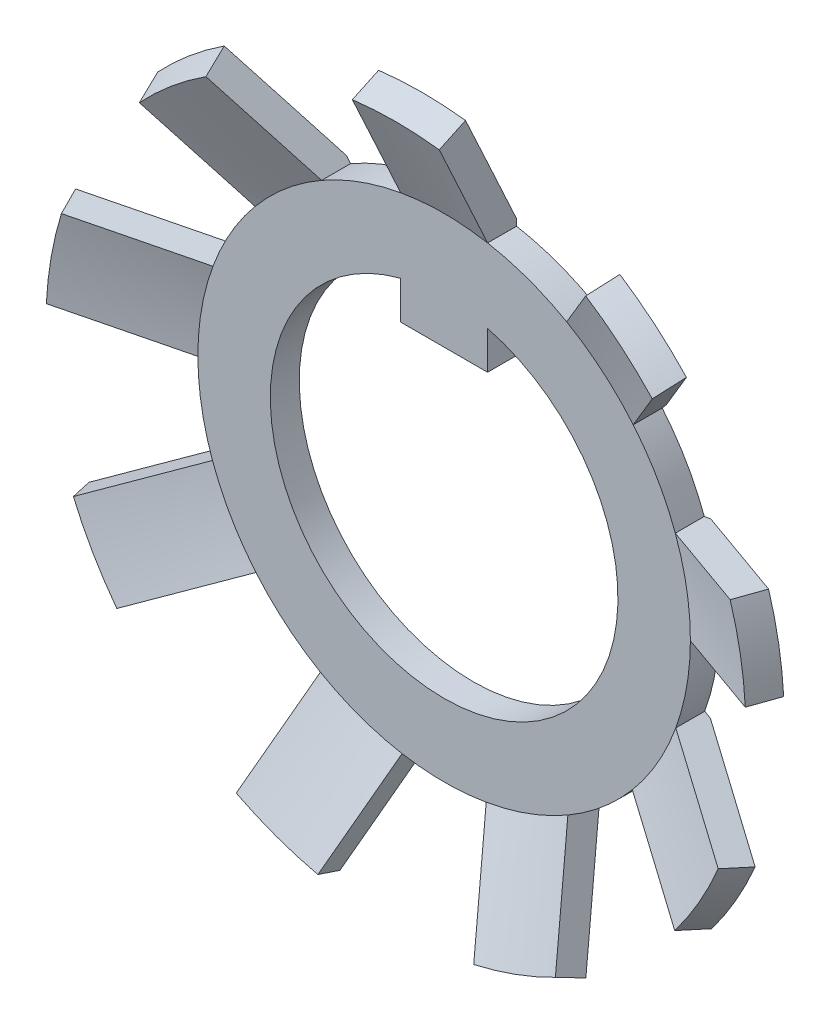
ISO-10303-21;
HEADER;
FILE_DESCRIPTION(('STEP AP214'),'2;1');
FILE_NAME('part.step','',(''),(''),'','','');
FILE_SCHEMA(('AUTOMOTIVE_DESIGN { 1 0 10303 214 1 1 1 1 }'));
ENDSEC;
DATA;
#1=APPLICATION_CONTEXT('core data for automotive mechanical design processes');
#2=APPLICATION_PROTOCOL_DEFINITION('international standard','automotive_design',2000,#1);
#3=PRODUCT_CONTEXT('',#1,'mechanical');
#4=PRODUCT('Part','Part','',(#3));
#5=PRODUCT_RELATED_PRODUCT_CATEGORY('part','',(#4));
#6=PRODUCT_DEFINITION_FORMATION('','',#4);
#7=PRODUCT_DEFINITION_CONTEXT('part definition',#1,'design');
#8=PRODUCT_DEFINITION('design','',#6,#7);
#9=PRODUCT_DEFINITION_SHAPE('','',#8);
#10=(LENGTH_UNIT() NAMED_UNIT(*) SI_UNIT(.MILLI.,.METRE.));
#11=(NAMED_UNIT(*) PLANE_ANGLE_UNIT() SI_UNIT($,.RADIAN.));
#12=(NAMED_UNIT(*) SI_UNIT($,.STERADIAN.) SOLID_ANGLE_UNIT());
#13=UNCERTAINTY_MEASURE_WITH_UNIT(LENGTH_MEASURE(1.E-05),#10,'distance_accuracy_value','');
#14=(GEOMETRIC_REPRESENTATION_CONTEXT(3) GLOBAL_UNCERTAINTY_ASSIGNED_CONTEXT((#13)) GLOBAL_UNIT_ASSIGNED_CONTEXT((#10,
#11,#12)) REPRESENTATION_CONTEXT('',''));
#15=CARTESIAN_POINT('',(0.,0.,0.));
#16=DIRECTION('',(0.,0.,1.));
#17=DIRECTION('',(1.,0.,0.));
#18=AXIS2_PLACEMENT_3D('',#15,#16,#17);
#19=CARTESIAN_POINT('',(0.,0.,1.7618527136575));
#20=DIRECTION('',(0.,0.,-1.));
#21=DIRECTION('',(-1.,0.,0.));
#22=AXIS2_PLACEMENT_3D('',#19,#20,#21);
#23=CONICAL_SURFACE('',#22,12.5,0.436332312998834);
#24=CARTESIAN_POINT('',(0.,0.,1.7618527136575));
#25=DIRECTION('',(0.,0.,1.));
#26=DIRECTION('',(1.,0.,0.));
#27=AXIS2_PLACEMENT_3D('',#24,#25,#26);
#28=CIRCLE('',#27,12.5);
#29=CARTESIAN_POINT('',(-11.960670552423,3.632128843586,1.76185271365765));
#30=VERTEX_POINT('',#29);
#31=CARTESIAN_POINT('',(-12.481615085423,0.67770558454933,1.76185271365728));
#32=VERTEX_POINT('',#31);
#33=EDGE_CURVE('E1000',#30,#32,#28,.T.);
#34=ORIENTED_EDGE('',*,*,#33,.T.);
#35=CARTESIAN_POINT('',(-12.4817075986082,0.677721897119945,1.7616527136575));
#36=CARTESIAN_POINT('',(-12.411802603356,0.665395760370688,1.91277779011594));
#37=CARTESIAN_POINT('',(-12.341890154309,0.65306830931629,2.06389931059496));
#38=CARTESIAN_POINT('',(-12.2020503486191,0.628410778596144,2.36613523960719));
#39=CARTESIAN_POINT('',(-12.1321229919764,0.616080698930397,2.51724964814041));
#40=CARTESIAN_POINT('',(-12.0621881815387,0.603749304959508,2.6683605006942));
#41=B_SPLINE_CURVE_WITH_KNOTS('',3,(#35,#36,#37,#38,#39,#40),.UNSPECIFIED.,.F.,.F.,(4,2,4),(0.,
0.500896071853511,1.00179214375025),.UNSPECIFIED.);
#42=CARTESIAN_POINT('',(-12.062280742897,0.603765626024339,2.6681605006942));
#43=VERTEX_POINT('',#42);
#44=EDGE_CURVE('E667',#32,#43,#41,.T.);
#45=ORIENTED_EDGE('',*,*,#44,.T.);
#46=CARTESIAN_POINT('',(0.,0.,2.6681605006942));
#47=DIRECTION('',(0.,0.,1.));
#48=DIRECTION('',(1.,0.,0.));
#49=AXIS2_PLACEMENT_3D('',#46,#47,#48);
#50=CIRCLE('',#49,12.077381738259);
#51=CARTESIAN_POINT('',(-11.5413362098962,3.55818888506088,2.6681605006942));
#52=VERTEX_POINT('',#51);
#53=EDGE_CURVE('E852',#52,#43,#50,.T.);
#54=ORIENTED_EDGE('',*,*,#53,.F.);
#55=CARTESIAN_POINT('',(-11.5412436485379,3.55817256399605,2.6683605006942));
#56=CARTESIAN_POINT('',(-11.6111784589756,3.57050395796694,2.5172496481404));
#57=CARTESIAN_POINT('',(-11.6811058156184,3.58283403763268,2.36613523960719));
#58=CARTESIAN_POINT('',(-11.8209456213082,3.60749156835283,2.06389931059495));
#59=CARTESIAN_POINT('',(-11.8908580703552,3.61981901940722,1.91277779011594));
#60=CARTESIAN_POINT('',(-11.9607630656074,3.63214515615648,1.7616527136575));
#61=B_SPLINE_CURVE_WITH_KNOTS('',3,(#55,#56,#57,#58,#59,#60),.UNSPECIFIED.,.F.,.F.,(4,2,4),(0.,
0.500896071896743,1.00179214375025),.UNSPECIFIED.);
#62=EDGE_CURVE('E373',#52,#30,#61,.T.);
#63=ORIENTED_EDGE('',*,*,#62,.T.);
#64=EDGE_LOOP('',(#34,#45,#54,#63));
#65=FACE_BOUND('',#64,.T.);
#66=ADVANCED_FACE('F33',(#65),#23,.T.);
#67=CARTESIAN_POINT('',(-11.1283361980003,-4.69289709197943,2.6681605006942));
#68=VERTEX_POINT('',#67);
#69=CARTESIAN_POINT('',(-9.62833619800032,-7.29097330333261,2.6681605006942));
#70=VERTEX_POINT('',#69);
#71=EDGE_CURVE('E856',#68,#70,#50,.T.);
#72=ORIENTED_EDGE('',*,*,#71,.F.);
#73=CARTESIAN_POINT('',(-11.1282548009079,-4.69285009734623,2.6683605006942));
#74=CARTESIAN_POINT('',(-11.1897544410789,-4.72835693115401,2.5172496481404));
#75=CARTESIAN_POINT('',(-11.2512475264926,-4.76385998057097,2.36613523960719));
#76=CARTESIAN_POINT('',(-11.3742205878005,-4.83485851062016,2.06389931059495));
#77=CARTESIAN_POINT('',(-11.4357005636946,-4.87035399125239,1.91277779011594));
#78=CARTESIAN_POINT('',(-11.4971739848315,-4.9058456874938,1.7616527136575));
#79=B_SPLINE_CURVE_WITH_KNOTS('',3,(#73,#74,#75,#76,#77,#78),.UNSPECIFIED.,.F.,.F.,(4,2,4),(0.,
0.500896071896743,1.00179214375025),.UNSPECIFIED.);
#80=CARTESIAN_POINT('',(-11.497092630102,-4.9057987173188,1.76185271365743));
#81=VERTEX_POINT('',#80);
#82=EDGE_CURVE('E650',#68,#81,#79,.T.);
#83=ORIENTED_EDGE('',*,*,#82,.T.);
#84=CARTESIAN_POINT('',(-9.99709263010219,-7.50387492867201,1.76185271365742));
#85=VERTEX_POINT('',#84);
#86=EDGE_CURVE('E996',#81,#85,#28,.T.);
#87=ORIENTED_EDGE('',*,*,#86,.T.);
#88=CARTESIAN_POINT('',(-9.99717398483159,-7.50392189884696,1.7616527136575));
#89=CARTESIAN_POINT('',(-9.93570056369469,-7.46843020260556,1.91277779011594));
#90=CARTESIAN_POINT('',(-9.87422058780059,-7.43293472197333,2.06389931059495));
#91=CARTESIAN_POINT('',(-9.7512475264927,-7.36193619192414,2.36613523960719));
#92=CARTESIAN_POINT('',(-9.68975444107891,-7.32643314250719,2.5172496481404));
#93=CARTESIAN_POINT('',(-9.62825480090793,-7.29092630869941,2.6683605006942));
#94=B_SPLINE_CURVE_WITH_KNOTS('',3,(#88,#89,#90,#91,#92,#93),.UNSPECIFIED.,.F.,.F.,(4,2,4),(0.,
0.50089607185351,1.00179214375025),.UNSPECIFIED.);
#95=EDGE_CURVE('E781',#85,#70,#94,.T.);
#96=ORIENTED_EDGE('',*,*,#95,.T.);
#97=EDGE_LOOP('',(#72,#83,#87,#96));
#98=FACE_BOUND('',#97,.T.);
#99=ADVANCED_FACE('F808',(#98),#23,.T.);
#100=CARTESIAN_POINT('',(-5.50826400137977,-10.7481243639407,2.6681605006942));
#101=VERTEX_POINT('',#100);
#102=CARTESIAN_POINT('',(-2.68918613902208,-11.7741847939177,2.6681605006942));
#103=VERTEX_POINT('',#102);
#104=EDGE_CURVE('E860',#101,#103,#50,.T.);
#105=ORIENTED_EDGE('',*,*,#104,.F.);
#106=CARTESIAN_POINT('',(-5.5082318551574,-10.7480360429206,2.6683605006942));
#107=CARTESIAN_POINT('',(-5.53251995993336,-10.8147670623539,2.5172496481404));
#108=CARTESIAN_POINT('',(-5.55680547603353,-10.8814909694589,2.36613523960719));
#109=CARTESIAN_POINT('',(-5.6053713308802,-11.0149245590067,2.06389931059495));
#110=CARTESIAN_POINT('',(-5.6296516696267,-11.0816342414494,1.91277779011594));
#111=CARTESIAN_POINT('',(-5.65392941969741,-11.1483368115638,1.7616527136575));
#112=B_SPLINE_CURVE_WITH_KNOTS('',3,(#106,#107,#108,#109,#110,#111),.UNSPECIFIED.,.F.,.F.,(4,2,
4),(0.,0.500896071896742,1.00179214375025),.UNSPECIFIED.);
#113=CARTESIAN_POINT('',(-5.6538972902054,-11.14824853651,1.76185271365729));
#114=VERTEX_POINT('',#113);
#115=EDGE_CURVE('E782',#101,#114,#112,.T.);
#116=ORIENTED_EDGE('',*,*,#115,.T.);
#117=CARTESIAN_POINT('',(-2.83481942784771,-12.174308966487,1.76185271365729));
#118=VERTEX_POINT('',#117);
#119=EDGE_CURVE('E989',#114,#118,#28,.T.);
#120=ORIENTED_EDGE('',*,*,#119,.T.);
#121=CARTESIAN_POINT('',(-2.83485155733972,-12.1743972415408,1.7616527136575));
#122=CARTESIAN_POINT('',(-2.81057380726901,-12.1076946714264,1.91277779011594));
#123=CARTESIAN_POINT('',(-2.78629346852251,-12.0409849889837,2.06389931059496));
#124=CARTESIAN_POINT('',(-2.73772761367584,-11.907551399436,2.36613523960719));
#125=CARTESIAN_POINT('',(-2.71344209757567,-11.8408274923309,2.5172496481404));
#126=CARTESIAN_POINT('',(-2.68915399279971,-11.7740964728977,2.6683605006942));
#127=B_SPLINE_CURVE_WITH_KNOTS('',3,(#121,#122,#123,#124,#125,#126),.UNSPECIFIED.,.F.,.F.,(4,2,
4),(0.,0.500896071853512,1.00179214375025),.UNSPECIFIED.);
#128=EDGE_CURVE('E977',#118,#103,#127,.T.);
#129=ORIENTED_EDGE('',*,*,#128,.T.);
#130=EDGE_LOOP('',(#105,#116,#120,#129));
#131=FACE_BOUND('',#130,.T.);
#132=ADVANCED_FACE('F813',(#131),#23,.T.);
#133=CARTESIAN_POINT('',(2.68918613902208,-11.7741847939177,2.6681605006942));
#134=VERTEX_POINT('',#133);
#135=CARTESIAN_POINT('',(5.50826400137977,-10.7481243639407,2.6681605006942));
#136=VERTEX_POINT('',#135);
#137=EDGE_CURVE('E865',#134,#136,#50,.T.);
#138=ORIENTED_EDGE('',*,*,#137,.F.);
#139=CARTESIAN_POINT('',(2.68915399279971,-11.7740964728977,2.6683605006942));
#140=CARTESIAN_POINT('',(2.71344209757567,-11.8408274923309,2.5172496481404));
#141=CARTESIAN_POINT('',(2.73772761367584,-11.907551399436,2.36613523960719));
#142=CARTESIAN_POINT('',(2.78629346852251,-12.0409849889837,2.06389931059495));
#143=CARTESIAN_POINT('',(2.81057380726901,-12.1076946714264,1.91277779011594));
#144=CARTESIAN_POINT('',(2.83485155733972,-12.1743972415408,1.7616527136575));
#145=B_SPLINE_CURVE_WITH_KNOTS('',3,(#139,#140,#141,#142,#143,#144),.UNSPECIFIED.,.F.,.F.,(4,2,
4),(0.,0.500896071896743,1.00179214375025),.UNSPECIFIED.);
#146=CARTESIAN_POINT('',(2.8348194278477,-12.174308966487,1.76185271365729));
#147=VERTEX_POINT('',#146);
#148=EDGE_CURVE('E958',#134,#147,#145,.T.);
#149=ORIENTED_EDGE('',*,*,#148,.T.);
#150=CARTESIAN_POINT('',(5.65389729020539,-11.14824853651,1.76185271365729));
#151=VERTEX_POINT('',#150);
#152=EDGE_CURVE('E997',#147,#151,#28,.T.);
#153=ORIENTED_EDGE('',*,*,#152,.T.);
#154=CARTESIAN_POINT('',(5.65392941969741,-11.1483368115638,1.7616527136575));
#155=CARTESIAN_POINT('',(5.6296516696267,-11.0816342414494,1.91277779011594));
#156=CARTESIAN_POINT('',(5.6053713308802,-11.0149245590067,2.06389931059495));
#157=CARTESIAN_POINT('',(5.55680547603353,-10.8814909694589,2.36613523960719));
#158=CARTESIAN_POINT('',(5.53251995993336,-10.8147670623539,2.5172496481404));
#159=CARTESIAN_POINT('',(5.5082318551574,-10.7480360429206,2.6683605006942));
#160=B_SPLINE_CURVE_WITH_KNOTS('',3,(#154,#155,#156,#157,#158,#159),.UNSPECIFIED.,.F.,.F.,(4,2,
4),(0.,0.50089607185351,1.00179214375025),.UNSPECIFIED.);
#161=EDGE_CURVE('E953',#151,#136,#160,.T.);
#162=ORIENTED_EDGE('',*,*,#161,.T.);
#163=EDGE_LOOP('',(#138,#149,#153,#162));
#164=FACE_BOUND('',#163,.T.);
#165=ADVANCED_FACE('F1215',(#164),#23,.T.);
#166=CARTESIAN_POINT('',(9.62833619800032,-7.29097330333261,2.6681605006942));
#167=VERTEX_POINT('',#166);
#168=CARTESIAN_POINT('',(11.1283361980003,-4.69289709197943,2.6681605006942));
#169=VERTEX_POINT('',#168);
#170=EDGE_CURVE('E870',#167,#169,#50,.T.);
#171=ORIENTED_EDGE('',*,*,#170,.F.);
#172=CARTESIAN_POINT('',(9.62825480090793,-7.29092630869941,2.6683605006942));
#173=CARTESIAN_POINT('',(9.68975444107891,-7.32643314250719,2.5172496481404));
#174=CARTESIAN_POINT('',(9.7512475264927,-7.36193619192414,2.36613523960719));
#175=CARTESIAN_POINT('',(9.87422058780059,-7.43293472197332,2.06389931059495));
#176=CARTESIAN_POINT('',(9.93570056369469,-7.46843020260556,1.91277779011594));
#177=CARTESIAN_POINT('',(9.99717398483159,-7.50392189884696,1.7616527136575));
#178=B_SPLINE_CURVE_WITH_KNOTS('',3,(#172,#173,#174,#175,#176,#177),.UNSPECIFIED.,.F.,.F.,(4,2,
4),(0.,0.500896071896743,1.00179214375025),.UNSPECIFIED.);
#179=CARTESIAN_POINT('',(9.9970926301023,-7.5038749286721,1.76185271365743));
#180=VERTEX_POINT('',#179);
#181=EDGE_CURVE('E931',#167,#180,#178,.T.);
#182=ORIENTED_EDGE('',*,*,#181,.T.);
#183=CARTESIAN_POINT('',(11.4970926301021,-4.90579871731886,1.76185271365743));
#184=VERTEX_POINT('',#183);
#185=EDGE_CURVE('E1001',#180,#184,#28,.T.);
#186=ORIENTED_EDGE('',*,*,#185,.T.);
#187=CARTESIAN_POINT('',(11.4971739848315,-4.9058456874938,1.7616527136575));
#188=CARTESIAN_POINT('',(11.4357005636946,-4.87035399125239,1.91277779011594));
#189=CARTESIAN_POINT('',(11.3742205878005,-4.83485851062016,2.06389931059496));
#190=CARTESIAN_POINT('',(11.2512475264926,-4.76385998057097,2.36613523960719));
#191=CARTESIAN_POINT('',(11.1897544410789,-4.72835693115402,2.5172496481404));
#192=CARTESIAN_POINT('',(11.1282548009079,-4.69285009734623,2.6683605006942));
#193=B_SPLINE_CURVE_WITH_KNOTS('',3,(#187,#188,#189,#190,#191,#192),.UNSPECIFIED.,.F.,.F.,(4,2,
4),(0.,0.500896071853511,1.00179214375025),.UNSPECIFIED.);
#194=EDGE_CURVE('E927',#184,#169,#193,.T.);
#195=ORIENTED_EDGE('',*,*,#194,.T.);
#196=EDGE_LOOP('',(#171,#182,#186,#195));
#197=FACE_BOUND('',#196,.T.);
#198=ADVANCED_FACE('F1213',(#197),#23,.T.);
#199=CARTESIAN_POINT('',(12.062280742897,0.603765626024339,2.6681605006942));
#200=VERTEX_POINT('',#199);
#201=CARTESIAN_POINT('',(11.5413362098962,3.5581888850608,2.6681605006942));
#202=VERTEX_POINT('',#201);
#203=EDGE_CURVE('E515',#200,#202,#50,.T.);
#204=ORIENTED_EDGE('',*,*,#203,.F.);
#205=CARTESIAN_POINT('',(12.0621881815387,0.603749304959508,2.6683605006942));
#206=CARTESIAN_POINT('',(12.1321229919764,0.616080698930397,2.51724964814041));
#207=CARTESIAN_POINT('',(12.2020503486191,0.628410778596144,2.36613523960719));
#208=CARTESIAN_POINT('',(12.341890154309,0.65306830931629,2.06389931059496));
#209=CARTESIAN_POINT('',(12.411802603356,0.665395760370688,1.91277779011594));
#210=CARTESIAN_POINT('',(12.4817075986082,0.677721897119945,1.7616527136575));
#211=B_SPLINE_CURVE_WITH_KNOTS('',3,(#205,#206,#207,#208,#209,#210),.UNSPECIFIED.,.F.,.F.,(4,2,
4),(0.,0.500896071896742,1.00179214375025),.UNSPECIFIED.);
#212=CARTESIAN_POINT('',(12.481615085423,0.67770558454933,1.76185271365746));
#213=VERTEX_POINT('',#212);
#214=EDGE_CURVE('E896',#200,#213,#211,.T.);
#215=ORIENTED_EDGE('',*,*,#214,.T.);
#216=CARTESIAN_POINT('',(11.9606705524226,3.63212884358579,1.76185271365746));
#217=VERTEX_POINT('',#216);
#218=EDGE_CURVE('E899',#213,#217,#28,.T.);
#219=ORIENTED_EDGE('',*,*,#218,.T.);
#220=CARTESIAN_POINT('',(11.9607630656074,3.63214515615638,1.7616527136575));
#221=CARTESIAN_POINT('',(11.8908580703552,3.61981901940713,1.91277779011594));
#222=CARTESIAN_POINT('',(11.8209456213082,3.60749156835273,2.06389931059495));
#223=CARTESIAN_POINT('',(11.6811058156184,3.5828340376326,2.36613523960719));
#224=CARTESIAN_POINT('',(11.6111784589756,3.57050395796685,2.5172496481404));
#225=CARTESIAN_POINT('',(11.541243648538,3.55817256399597,2.6683605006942));
#226=B_SPLINE_CURVE_WITH_KNOTS('',3,(#220,#221,#222,#223,#224,#225),.UNSPECIFIED.,.F.,.F.,(4,2,
4),(0.,0.500896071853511,1.00179214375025),.UNSPECIFIED.);
#227=EDGE_CURVE('E898',#217,#202,#226,.T.);
#228=ORIENTED_EDGE('',*,*,#227,.T.);
#229=EDGE_LOOP('',(#204,#215,#219,#228));
#230=FACE_BOUND('',#229,.T.);
#231=ADVANCED_FACE('F834',(#230),#23,.T.);
#232=CARTESIAN_POINT('',(8.85215007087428,8.21599590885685,2.6681605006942));
#233=VERTEX_POINT('',#232);
#234=CARTESIAN_POINT('',(6.55401674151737,10.1443587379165,2.6681605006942));
#235=VERTEX_POINT('',#234);
#236=EDGE_CURVE('E848',#233,#235,#50,.T.);
#237=ORIENTED_EDGE('',*,*,#236,.F.);
#238=CARTESIAN_POINT('',(8.85208965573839,8.21592390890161,2.6683605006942));
#239=CARTESIAN_POINT('',(8.89773636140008,8.27032353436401,2.5172496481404));
#240=CARTESIAN_POINT('',(8.94337820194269,8.32471736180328,2.36613523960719));
#241=CARTESIAN_POINT('',(9.03465215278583,8.43349342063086,2.06389931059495));
#242=CARTESIAN_POINT('',(9.08028426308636,8.48787565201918,1.91277779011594));
#243=CARTESIAN_POINT('',(9.12591150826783,8.54225208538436,1.7616527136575));
#244=B_SPLINE_CURVE_WITH_KNOTS('',3,(#238,#239,#240,#241,#242,#243),.UNSPECIFIED.,.F.,.F.,(4,2,
4),(0.,0.500896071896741,1.00179214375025),.UNSPECIFIED.);
#245=CARTESIAN_POINT('',(9.125851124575,8.5421801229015,1.76185271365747));
#246=VERTEX_POINT('',#245);
#247=EDGE_CURVE('E903',#233,#246,#244,.T.);
#248=ORIENTED_EDGE('',*,*,#247,.T.);
#249=CARTESIAN_POINT('',(6.82771779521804,10.4705429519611,1.76185271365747));
#250=VERTEX_POINT('',#249);
#251=EDGE_CURVE('E1005',#246,#250,#28,.T.);
#252=ORIENTED_EDGE('',*,*,#251,.T.);
#253=CARTESIAN_POINT('',(6.82777817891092,10.470614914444,1.7616527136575));
#254=CARTESIAN_POINT('',(6.78215093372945,10.4162384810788,1.91277779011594));
#255=CARTESIAN_POINT('',(6.73651882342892,10.3618562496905,2.06389931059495));
#256=CARTESIAN_POINT('',(6.64524487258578,10.2530801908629,2.36613523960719));
#257=CARTESIAN_POINT('',(6.59960303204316,10.1986863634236,2.5172496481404));
#258=CARTESIAN_POINT('',(6.55395632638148,10.1442867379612,2.6683605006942));
#259=B_SPLINE_CURVE_WITH_KNOTS('',3,(#253,#254,#255,#256,#257,#258),.UNSPECIFIED.,.F.,.F.,(4,2,
4),(0.,0.500896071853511,1.00179214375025),.UNSPECIFIED.);
#260=EDGE_CURVE('E1054',#250,#235,#259,.T.);
#261=ORIENTED_EDGE('',*,*,#260,.T.);
#262=EDGE_LOOP('',(#237,#248,#252,#261));
#263=FACE_BOUND('',#262,.T.);
#264=ADVANCED_FACE('F826',(#263),#23,.T.);
#265=CARTESIAN_POINT('',(1.5,11.9838703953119,2.6681605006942));
#266=VERTEX_POINT('',#265);
#267=CARTESIAN_POINT('',(-1.5,11.9838703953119,2.6681605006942));
#268=VERTEX_POINT('',#267);
#269=EDGE_CURVE('E840',#266,#268,#50,.T.);
#270=ORIENTED_EDGE('',*,*,#269,.F.);
#271=CARTESIAN_POINT('',(1.5,8.83257800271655,9.355461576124));
#272=CARTESIAN_POINT('',(1.5,9.10938268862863,8.77021420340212));
#273=CARTESIAN_POINT('',(1.5,9.38590316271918,8.18483253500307));
#274=CARTESIAN_POINT('',(1.5,9.93848449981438,7.01385244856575));
#275=CARTESIAN_POINT('',(1.5,10.2145453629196,6.42825403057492));
#276=CARTESIAN_POINT('',(1.5,11.0422015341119,4.67121188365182));
#277=CARTESIAN_POINT('',(1.5,11.5932708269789,3.49952040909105));
#278=CARTESIAN_POINT('',(1.5,12.6945105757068,1.15571608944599));
#279=CARTESIAN_POINT('',(1.5,13.2446810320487,-0.0163967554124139));
#280=CARTESIAN_POINT('',(1.5,14.3443834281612,-2.36092301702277));
#281=CARTESIAN_POINT('',(1.5,14.8939153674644,-3.53333643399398));
#282=CARTESIAN_POINT('',(1.5,15.4432576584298,-4.70583856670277));
#283=B_SPLINE_CURVE_WITH_KNOTS('',3,(#271,#272,#273,#274,#275,#276,#277,#278,#279,#280,#281,
#282),.UNSPECIFIED.,.F.,.F.,(4,2,2,2,2,4),(0.,1.94221959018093,3.88443875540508,
7.76887425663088,11.653307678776,15.5377439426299),.UNSPECIFIED.);
#284=CARTESIAN_POINT('',(1.5,12.409673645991,1.76185271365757));
#285=VERTEX_POINT('',#284);
#286=EDGE_CURVE('E842',#266,#285,#283,.T.);
#287=ORIENTED_EDGE('',*,*,#286,.T.);
#288=CARTESIAN_POINT('',(-1.5,12.409673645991,1.76185271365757));
#289=VERTEX_POINT('',#288);
#290=EDGE_CURVE('E1138',#285,#289,#28,.T.);
#291=ORIENTED_EDGE('',*,*,#290,.T.);
#292=CARTESIAN_POINT('',(-1.5,15.4432576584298,-4.70583856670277));
#293=CARTESIAN_POINT('',(-1.5,14.8939153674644,-3.53333643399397));
#294=CARTESIAN_POINT('',(-1.5,14.3443834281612,-2.36092301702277));
#295=CARTESIAN_POINT('',(-1.5,13.2446810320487,-0.0163967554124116));
#296=CARTESIAN_POINT('',(-1.5,12.6945105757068,1.155716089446));
#297=CARTESIAN_POINT('',(-1.5,11.5932708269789,3.49952040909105));
#298=CARTESIAN_POINT('',(-1.5,11.0422015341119,4.67121188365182));
#299=CARTESIAN_POINT('',(-1.5,10.2145453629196,6.42825403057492));
#300=CARTESIAN_POINT('',(-1.5,9.93848449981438,7.01385244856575));
#301=CARTESIAN_POINT('',(-1.5,9.38590316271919,8.18483253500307));
#302=CARTESIAN_POINT('',(-1.5,9.10938268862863,8.77021420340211));
#303=CARTESIAN_POINT('',(-1.5,8.83257800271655,9.355461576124));
#304=B_SPLINE_CURVE_WITH_KNOTS('',3,(#292,#293,#294,#295,#296,#297,#298,#299,#300,#301,#302,
#303),.UNSPECIFIED.,.F.,.F.,(4,2,2,2,2,4),(0.,3.8844362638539,7.76886968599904,11.6533051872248,
13.595524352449,15.5377439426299),.UNSPECIFIED.);
#305=EDGE_CURVE('E844',#289,#268,#304,.T.);
#306=ORIENTED_EDGE('',*,*,#305,.T.);
#307=EDGE_LOOP('',(#270,#287,#291,#306));
#308=FACE_BOUND('',#307,.T.);
#309=ADVANCED_FACE('F818',(#308),#23,.T.);
#310=CARTESIAN_POINT('',(0.,0.,2.6681605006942));
#311=DIRECTION('',(0.,0.,1.));
#312=DIRECTION('',(1.,0.,0.));
#313=AXIS2_PLACEMENT_3D('',#310,#311,#312);
#314=CONICAL_SURFACE('',#313,12.077381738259,1.13446401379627);
#315=ORIENTED_EDGE('',*,*,#53,.T.);
#316=CARTESIAN_POINT('',(-12.0627064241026,0.603840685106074,2.6683605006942));
#317=CARTESIAN_POINT('',(-11.7659667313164,0.551517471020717,2.52894402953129));
#318=CARTESIAN_POINT('',(-11.4691983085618,0.49918919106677,2.38959055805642));
#319=CARTESIAN_POINT('',(-10.8755844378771,0.39451904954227,2.11105332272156));
#320=CARTESIAN_POINT('',(-10.5787389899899,0.342177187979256,1.97186955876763));
#321=CARTESIAN_POINT('',(-9.98495109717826,0.237476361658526,1.69371525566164));
#322=CARTESIAN_POINT('',(-9.6880086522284,0.185117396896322,1.55474471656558));
#323=CARTESIAN_POINT('',(-9.09399315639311,0.0803764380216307,1.27709133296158));
#324=CARTESIAN_POINT('',(-8.7969201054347,0.0279944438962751,1.13840848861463));
#325=CARTESIAN_POINT('',(-8.499765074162,-0.0244020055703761,0.99990678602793));
#326=B_SPLINE_CURVE_WITH_KNOTS('',3,(#316,#317,#318,#319,#320,#321,#322,#323,#324,#325),
.UNSPECIFIED.,.F.,.F.,(4,2,2,2,4),(0.,0.996023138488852,1.99204572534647,2.988068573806,
3.98409197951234),.UNSPECIFIED.);
#327=CARTESIAN_POINT('',(-8.499965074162,-0.024366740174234,1.));
#328=VERTEX_POINT('',#327);
#329=EDGE_CURVE('E1486',#43,#328,#326,.T.);
#330=ORIENTED_EDGE('',*,*,#329,.T.);
#331=CARTESIAN_POINT('',(0.,0.,1.));
#332=DIRECTION('',(0.,0.,1.));
#333=DIRECTION('',(1.,0.,0.));
#334=AXIS2_PLACEMENT_3D('',#331,#332,#333);
#335=CIRCLE('',#334,8.5);
#336=CARTESIAN_POINT('',(-7.97902054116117,2.93005651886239,1.));
#337=VERTEX_POINT('',#336);
#338=EDGE_CURVE('E1031',#337,#328,#335,.T.);
#339=ORIENTED_EDGE('',*,*,#338,.F.);
#340=CARTESIAN_POINT('',(-7.97882054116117,2.93002125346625,0.999906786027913));
#341=CARTESIAN_POINT('',(-8.27597557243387,2.9824177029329,1.13840848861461));
#342=CARTESIAN_POINT('',(-8.57304862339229,3.03479969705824,1.27709133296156));
#343=CARTESIAN_POINT('',(-9.16706411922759,3.13954065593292,1.55474471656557));
#344=CARTESIAN_POINT('',(-9.46400656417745,3.19189962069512,1.69371525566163));
#345=CARTESIAN_POINT('',(-10.0577944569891,3.29660044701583,1.97186955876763));
#346=CARTESIAN_POINT('',(-10.3546399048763,3.34894230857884,2.11105332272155));
#347=CARTESIAN_POINT('',(-10.948253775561,3.45361245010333,2.38959055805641));
#348=CARTESIAN_POINT('',(-11.2450221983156,3.50594073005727,2.52894402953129));
#349=CARTESIAN_POINT('',(-11.5417618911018,3.55826394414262,2.6683605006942));
#350=B_SPLINE_CURVE_WITH_KNOTS('',3,(#340,#341,#342,#343,#344,#345,#346,#347,#348,#349),
.UNSPECIFIED.,.F.,.F.,(4,2,2,2,4),(0.,0.996023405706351,1.99204625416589,2.98806884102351,
3.98409197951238),.UNSPECIFIED.);
#351=EDGE_CURVE('E490',#337,#52,#350,.T.);
#352=ORIENTED_EDGE('',*,*,#351,.T.);
#353=EDGE_LOOP('',(#315,#330,#339,#352));
#354=FACE_BOUND('',#353,.T.);
#355=ADVANCED_FACE('F678',(#354),#314,.F.);
#356=CARTESIAN_POINT('',(-7.99568837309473,-2.88426202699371,1.));
#357=VERTEX_POINT('',#356);
#358=CARTESIAN_POINT('',(-6.4956883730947,-5.482338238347,1.));
#359=VERTEX_POINT('',#358);
#360=EDGE_CURVE('E1028',#357,#359,#335,.T.);
#361=ORIENTED_EDGE('',*,*,#360,.F.);
#362=CARTESIAN_POINT('',(-7.99548837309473,-2.88414655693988,0.99989400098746));
#363=CARTESIAN_POINT('',(-8.25680413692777,-3.0350172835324,1.13839675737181));
#364=CARTESIAN_POINT('',(-8.51804780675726,-3.18584638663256,1.2770806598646));
#365=CARTESIAN_POINT('',(-9.04042029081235,-3.48743828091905,1.55473616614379));
#366=CARTESIAN_POINT('',(-9.30154910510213,-3.63820107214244,1.69370776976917));
#367=CARTESIAN_POINT('',(-9.82372143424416,-3.939677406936,1.97186420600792));
#368=CARTESIAN_POINT('',(-10.0847649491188,-4.0903909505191,2.11104903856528));
#369=CARTESIAN_POINT('',(-10.6067842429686,-4.39177893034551,2.38958841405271));
#370=CARTESIAN_POINT('',(-10.8677600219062,-4.54245336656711,2.52894295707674));
#371=CARTESIAN_POINT('',(-11.1287105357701,-4.69311321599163,2.6683605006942));
#372=B_SPLINE_CURVE_WITH_KNOTS('',3,(#362,#363,#364,#365,#366,#367,#368,#369,#370,#371),
.UNSPECIFIED.,.F.,.F.,(4,2,2,2,4),(0.,0.996031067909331,1.99206157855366,2.98809182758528,
3.984122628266),.UNSPECIFIED.);
#373=EDGE_CURVE('E656',#357,#68,#372,.T.);
#374=ORIENTED_EDGE('',*,*,#373,.T.);
#375=ORIENTED_EDGE('',*,*,#71,.T.);
#376=CARTESIAN_POINT('',(-9.62871053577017,-7.2911894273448,2.6683605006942));
#377=CARTESIAN_POINT('',(-9.36776002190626,-7.14052957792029,2.52894295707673));
#378=CARTESIAN_POINT('',(-9.10678424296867,-6.9898551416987,2.38958841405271));
#379=CARTESIAN_POINT('',(-8.58476494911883,-6.68846716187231,2.11104903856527));
#380=CARTESIAN_POINT('',(-8.32372143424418,-6.53775361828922,1.97186420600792));
#381=CARTESIAN_POINT('',(-7.80154910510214,-6.23627728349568,1.69370776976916));
#382=CARTESIAN_POINT('',(-7.54042029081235,-6.0855144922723,1.55473616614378));
#383=CARTESIAN_POINT('',(-7.01804780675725,-5.78392259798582,1.27708065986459));
#384=CARTESIAN_POINT('',(-6.75680413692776,-5.63309349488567,1.13839675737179));
#385=CARTESIAN_POINT('',(-6.4954883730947,-5.48222276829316,0.99989400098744));
#386=B_SPLINE_CURVE_WITH_KNOTS('',3,(#376,#377,#378,#379,#380,#381,#382,#383,#384,#385),
.UNSPECIFIED.,.F.,.F.,(4,2,2,2,4),(0.,0.996030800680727,1.99206104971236,2.98809156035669,
3.98412262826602),.UNSPECIFIED.);
#387=EDGE_CURVE('E657',#70,#359,#386,.T.);
#388=ORIENTED_EDGE('',*,*,#387,.T.);
#389=EDGE_LOOP('',(#361,#374,#375,#388));
#390=FACE_BOUND('',#389,.T.);
#391=ADVANCED_FACE('F832',(#390),#314,.F.);
#392=CARTESIAN_POINT('',(-4.2710847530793,-7.34900231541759,1.));
#393=VERTEX_POINT('',#392);
#394=CARTESIAN_POINT('',(-1.4520068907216,-8.3750627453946,1.));
#395=VERTEX_POINT('',#394);
#396=EDGE_CURVE('E1026',#393,#395,#335,.T.);
#397=ORIENTED_EDGE('',*,*,#396,.F.);
#398=CARTESIAN_POINT('',(-4.27101195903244,-7.34880231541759,0.999902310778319));
#399=CARTESIAN_POINT('',(-4.37421309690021,-7.63234511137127,1.13840438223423));
#400=CARTESIAN_POINT('',(-4.47738576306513,-7.91580968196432,1.27708759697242));
#401=CARTESIAN_POINT('',(-4.6836857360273,-8.48261419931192,1.55474172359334));
#402=CARTESIAN_POINT('',(-4.78681304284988,-8.76595414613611,1.69371263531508));
#403=CARTESIAN_POINT('',(-4.99303396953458,-9.33254148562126,1.97186768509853));
#404=CARTESIAN_POINT('',(-5.09612758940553,-9.61578887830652,2.11105182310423));
#405=CARTESIAN_POINT('',(-5.30228807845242,-10.1822101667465,2.38958980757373));
#406=CARTESIAN_POINT('',(-5.4053549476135,-10.4653840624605,2.52894365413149));
#407=CARTESIAN_POINT('',(-5.50841183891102,-10.7485305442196,2.6683605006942));
#408=B_SPLINE_CURVE_WITH_KNOTS('',3,(#398,#399,#400,#401,#402,#403,#404,#405,#406,#407),
.UNSPECIFIED.,.F.,.F.,(4,2,2,2,4),(0.,0.996026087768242,1.9920516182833,2.98807688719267,
3.98410270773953),.UNSPECIFIED.);
#409=EDGE_CURVE('E776',#393,#101,#408,.T.);
#410=ORIENTED_EDGE('',*,*,#409,.T.);
#411=ORIENTED_EDGE('',*,*,#104,.T.);
#412=CARTESIAN_POINT('',(-2.68933397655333,-11.7745909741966,2.6683605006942));
#413=CARTESIAN_POINT('',(-2.58627708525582,-11.4914444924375,2.52894365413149));
#414=CARTESIAN_POINT('',(-2.48321021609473,-11.2082705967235,2.38958980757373));
#415=CARTESIAN_POINT('',(-2.27704972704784,-10.6418493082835,2.11105182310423));
#416=CARTESIAN_POINT('',(-2.17395610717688,-10.3586019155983,1.97186768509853));
#417=CARTESIAN_POINT('',(-1.96773518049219,-9.79201457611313,1.69371263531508));
#418=CARTESIAN_POINT('',(-1.86460787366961,-9.50867462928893,1.55474172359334));
#419=CARTESIAN_POINT('',(-1.65830790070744,-8.94187011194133,1.27708759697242));
#420=CARTESIAN_POINT('',(-1.55513523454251,-8.65840554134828,1.13840438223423));
#421=CARTESIAN_POINT('',(-1.45193409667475,-8.3748627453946,0.99990231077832));
#422=B_SPLINE_CURVE_WITH_KNOTS('',3,(#412,#413,#414,#415,#416,#417,#418,#419,#420,#421),
.UNSPECIFIED.,.F.,.F.,(4,2,2,2,4),(0.,0.996025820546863,1.99205108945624,2.9880766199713,
3.98410270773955),.UNSPECIFIED.);
#423=EDGE_CURVE('E769',#103,#395,#422,.T.);
#424=ORIENTED_EDGE('',*,*,#423,.T.);
#425=EDGE_LOOP('',(#397,#410,#411,#424));
#426=FACE_BOUND('',#425,.T.);
#427=ADVANCED_FACE('F1531',(#426),#314,.F.);
#428=CARTESIAN_POINT('',(1.4520068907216,-8.3750627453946,1.));
#429=VERTEX_POINT('',#428);
#430=CARTESIAN_POINT('',(4.2710847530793,-7.3490023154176,1.));
#431=VERTEX_POINT('',#430);
#432=EDGE_CURVE('E1023',#429,#431,#335,.T.);
#433=ORIENTED_EDGE('',*,*,#432,.F.);
#434=CARTESIAN_POINT('',(1.45193409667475,-8.3748627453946,0.999902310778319));
#435=CARTESIAN_POINT('',(1.55513523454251,-8.65840554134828,1.13840438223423));
#436=CARTESIAN_POINT('',(1.65830790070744,-8.94187011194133,1.27708759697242));
#437=CARTESIAN_POINT('',(1.86460787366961,-9.50867462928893,1.55474172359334));
#438=CARTESIAN_POINT('',(1.96773518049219,-9.79201457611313,1.69371263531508));
#439=CARTESIAN_POINT('',(2.17395610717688,-10.3586019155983,1.97186768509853));
#440=CARTESIAN_POINT('',(2.27704972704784,-10.6418493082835,2.11105182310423));
#441=CARTESIAN_POINT('',(2.48321021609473,-11.2082705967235,2.38958980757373));
#442=CARTESIAN_POINT('',(2.58627708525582,-11.4914444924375,2.52894365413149));
#443=CARTESIAN_POINT('',(2.68933397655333,-11.7745909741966,2.6683605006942));
#444=B_SPLINE_CURVE_WITH_KNOTS('',3,(#434,#435,#436,#437,#438,#439,#440,#441,#442,#443),
.UNSPECIFIED.,.F.,.F.,(4,2,2,2,4),(0.,0.996026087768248,1.99205161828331,2.98807688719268,
3.98410270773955),.UNSPECIFIED.);
#445=EDGE_CURVE('E762',#429,#134,#444,.T.);
#446=ORIENTED_EDGE('',*,*,#445,.T.);
#447=ORIENTED_EDGE('',*,*,#137,.T.);
#448=CARTESIAN_POINT('',(5.50841183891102,-10.7485305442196,2.6683605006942));
#449=CARTESIAN_POINT('',(5.4053549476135,-10.4653840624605,2.52894365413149));
#450=CARTESIAN_POINT('',(5.30228807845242,-10.1822101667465,2.38958980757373));
#451=CARTESIAN_POINT('',(5.09612758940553,-9.61578887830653,2.11105182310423));
#452=CARTESIAN_POINT('',(4.99303396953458,-9.33254148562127,1.97186768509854));
#453=CARTESIAN_POINT('',(4.78681304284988,-8.76595414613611,1.69371263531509));
#454=CARTESIAN_POINT('',(4.6836857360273,-8.48261419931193,1.55474172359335));
#455=CARTESIAN_POINT('',(4.47738576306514,-7.91580968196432,1.27708759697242));
#456=CARTESIAN_POINT('',(4.37421309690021,-7.63234511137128,1.13840438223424));
#457=CARTESIAN_POINT('',(4.27101195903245,-7.3488023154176,0.999902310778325));
#458=B_SPLINE_CURVE_WITH_KNOTS('',3,(#448,#449,#450,#451,#452,#453,#454,#455,#456,#457),
.UNSPECIFIED.,.F.,.F.,(4,2,2,2,4),(0.,0.996025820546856,1.99205108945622,2.98807661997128,
3.98410270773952),.UNSPECIFIED.);
#459=EDGE_CURVE('E755',#136,#431,#458,.T.);
#460=ORIENTED_EDGE('',*,*,#459,.T.);
#461=EDGE_LOOP('',(#433,#446,#447,#460));
#462=FACE_BOUND('',#461,.T.);
#463=ADVANCED_FACE('F1527',(#462),#314,.F.);
#464=CARTESIAN_POINT('',(6.49568837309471,-5.48233823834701,1.));
#465=VERTEX_POINT('',#464);
#466=CARTESIAN_POINT('',(7.9956883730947,-2.8842620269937,1.));
#467=VERTEX_POINT('',#466);
#468=EDGE_CURVE('E1019',#465,#467,#335,.T.);
#469=ORIENTED_EDGE('',*,*,#468,.F.);
#470=CARTESIAN_POINT('',(6.49548837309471,-5.48222276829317,0.999894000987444));
#471=CARTESIAN_POINT('',(6.75680413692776,-5.63309349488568,1.13839675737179));
#472=CARTESIAN_POINT('',(7.01804780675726,-5.78392259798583,1.27708065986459));
#473=CARTESIAN_POINT('',(7.54042029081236,-6.0855144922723,1.55473616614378));
#474=CARTESIAN_POINT('',(7.80154910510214,-6.23627728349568,1.69370776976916));
#475=CARTESIAN_POINT('',(8.32372143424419,-6.53775361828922,1.97186420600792));
#476=CARTESIAN_POINT('',(8.58476494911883,-6.68846716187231,2.11104903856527));
#477=CARTESIAN_POINT('',(9.10678424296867,-6.9898551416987,2.38958841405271));
#478=CARTESIAN_POINT('',(9.36776002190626,-7.14052957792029,2.52894295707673));
#479=CARTESIAN_POINT('',(9.62871053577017,-7.2911894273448,2.6683605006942));
#480=B_SPLINE_CURVE_WITH_KNOTS('',3,(#470,#471,#472,#473,#474,#475,#476,#477,#478,#479),
.UNSPECIFIED.,.F.,.F.,(4,2,2,2,4),(0.,0.996031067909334,1.99206157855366,2.98809182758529,
3.98412262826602),.UNSPECIFIED.);
#481=EDGE_CURVE('E748',#465,#167,#480,.T.);
#482=ORIENTED_EDGE('',*,*,#481,.T.);
#483=ORIENTED_EDGE('',*,*,#170,.T.);
#484=CARTESIAN_POINT('',(11.1287105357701,-4.69311321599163,2.6683605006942));
#485=CARTESIAN_POINT('',(10.8677600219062,-4.54245336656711,2.52894295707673));
#486=CARTESIAN_POINT('',(10.6067842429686,-4.3917789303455,2.38958841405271));
#487=CARTESIAN_POINT('',(10.0847649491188,-4.09039095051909,2.11104903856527));
#488=CARTESIAN_POINT('',(9.82372143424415,-3.93967740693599,1.97186420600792));
#489=CARTESIAN_POINT('',(9.30154910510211,-3.63820107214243,1.69370776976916));
#490=CARTESIAN_POINT('',(9.04042029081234,-3.48743828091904,1.55473616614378));
#491=CARTESIAN_POINT('',(8.51804780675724,-3.18584638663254,1.27708065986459));
#492=CARTESIAN_POINT('',(8.25680413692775,-3.03501728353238,1.13839675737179));
#493=CARTESIAN_POINT('',(7.9954883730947,-2.88414655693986,0.999894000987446));
#494=B_SPLINE_CURVE_WITH_KNOTS('',3,(#484,#485,#486,#487,#488,#489,#490,#491,#492,#493),
.UNSPECIFIED.,.F.,.F.,(4,2,2,2,4),(0.,0.996030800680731,1.99206104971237,2.9880915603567,
3.98412262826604),.UNSPECIFIED.);
#495=EDGE_CURVE('E741',#169,#467,#494,.T.);
#496=ORIENTED_EDGE('',*,*,#495,.T.);
#497=EDGE_LOOP('',(#469,#482,#483,#496));
#498=FACE_BOUND('',#497,.T.);
#499=ADVANCED_FACE('F1523',(#498),#314,.F.);
#500=CARTESIAN_POINT('',(8.49996507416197,-0.0243667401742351,1.));
#501=VERTEX_POINT('',#500);
#502=CARTESIAN_POINT('',(7.9790205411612,2.9300565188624,1.));
#503=VERTEX_POINT('',#502);
#504=EDGE_CURVE('E883',#501,#503,#335,.T.);
#505=ORIENTED_EDGE('',*,*,#504,.F.);
#506=CARTESIAN_POINT('',(8.49976507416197,-0.0244020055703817,0.999906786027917));
#507=CARTESIAN_POINT('',(8.79692010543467,0.0279944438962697,1.13840848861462));
#508=CARTESIAN_POINT('',(9.09399315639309,0.0803764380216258,1.27709133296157));
#509=CARTESIAN_POINT('',(9.68800865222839,0.185117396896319,1.55474471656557));
#510=CARTESIAN_POINT('',(9.98495109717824,0.237476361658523,1.69371525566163));
#511=CARTESIAN_POINT('',(10.5787389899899,0.342177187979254,1.97186955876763));
#512=CARTESIAN_POINT('',(10.8755844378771,0.394519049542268,2.11105332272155));
#513=CARTESIAN_POINT('',(11.4691983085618,0.499189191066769,2.38959055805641));
#514=CARTESIAN_POINT('',(11.7659667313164,0.551517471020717,2.52894402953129));
#515=CARTESIAN_POINT('',(12.0627064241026,0.603840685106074,2.6683605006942));
#516=B_SPLINE_CURVE_WITH_KNOTS('',3,(#506,#507,#508,#509,#510,#511,#512,#513,#514,#515),
.UNSPECIFIED.,.F.,.F.,(4,2,2,2,4),(0.,0.996023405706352,1.99204625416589,2.98806884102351,
3.98409197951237),.UNSPECIFIED.);
#517=EDGE_CURVE('E734',#501,#200,#516,.T.);
#518=ORIENTED_EDGE('',*,*,#517,.T.);
#519=ORIENTED_EDGE('',*,*,#203,.T.);
#520=CARTESIAN_POINT('',(11.5417618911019,3.55826394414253,2.6683605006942));
#521=CARTESIAN_POINT('',(11.2450221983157,3.50594073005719,2.52894402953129));
#522=CARTESIAN_POINT('',(10.948253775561,3.45361245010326,2.38959055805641));
#523=CARTESIAN_POINT('',(10.3546399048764,3.34894230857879,2.11105332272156));
#524=CARTESIAN_POINT('',(10.0577944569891,3.29660044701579,1.97186955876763));
#525=CARTESIAN_POINT('',(9.46400656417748,3.19189962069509,1.69371525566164));
#526=CARTESIAN_POINT('',(9.16706411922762,3.1395406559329,1.55474471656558));
#527=CARTESIAN_POINT('',(8.57304862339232,3.03479969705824,1.27709133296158));
#528=CARTESIAN_POINT('',(8.2759755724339,2.98241770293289,1.13840848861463));
#529=CARTESIAN_POINT('',(7.9788205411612,2.93002125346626,0.999906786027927));
#530=B_SPLINE_CURVE_WITH_KNOTS('',3,(#520,#521,#522,#523,#524,#525,#526,#527,#528,#529),
.UNSPECIFIED.,.F.,.F.,(4,2,2,2,4),(0.,0.996023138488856,1.99204572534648,2.988068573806,
3.98409197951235),.UNSPECIFIED.);
#531=EDGE_CURVE('E727',#202,#503,#530,.T.);
#532=ORIENTED_EDGE('',*,*,#531,.T.);
#533=EDGE_LOOP('',(#505,#518,#519,#532));
#534=FACE_BOUND('',#533,.T.);
#535=ADVANCED_FACE('F890',(#534),#314,.F.);
#536=CARTESIAN_POINT('',(6.52701365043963,5.44500622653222,1.));
#537=VERTEX_POINT('',#536);
#538=CARTESIAN_POINT('',(4.2288803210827,7.3733690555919,1.));
#539=VERTEX_POINT('',#538);
#540=EDGE_CURVE('E882',#537,#539,#335,.T.);
#541=ORIENTED_EDGE('',*,*,#540,.F.);
#542=CARTESIAN_POINT('',(6.52684583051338,5.44480622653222,0.99988016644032));
#543=CARTESIAN_POINT('',(6.72080311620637,5.67595551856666,1.13838406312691));
#544=CARTESIAN_POINT('',(6.9147068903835,5.90704103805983,1.27706911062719));
#545=CARTESIAN_POINT('',(7.30242918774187,6.36911047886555,1.55472691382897));
#546=CARTESIAN_POINT('',(7.49624771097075,6.60009440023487,1.69369966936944));
#547=CARTESIAN_POINT('',(7.88382144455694,7.06198678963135,1.971858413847));
#548=CARTESIAN_POINT('',(8.07757665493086,7.29289525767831,2.11104440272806));
#549=CARTESIAN_POINT('',(8.46503679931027,7.75465227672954,2.38958609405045));
#550=CARTESIAN_POINT('',(8.65874173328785,7.98550082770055,2.52894179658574));
#551=CARTESIAN_POINT('',(8.85242791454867,8.21632703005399,2.6683605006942));
#552=B_SPLINE_CURVE_WITH_KNOTS('',3,(#542,#543,#544,#545,#546,#547,#548,#549,#550,#551),
.UNSPECIFIED.,.F.,.F.,(4,2,2,2,4),(0.,0.996039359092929,1.99207816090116,2.98811670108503,
3.98415579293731),.UNSPECIFIED.);
#553=EDGE_CURVE('E720',#537,#233,#552,.T.);
#554=ORIENTED_EDGE('',*,*,#553,.T.);
#555=ORIENTED_EDGE('',*,*,#236,.T.);
#556=CARTESIAN_POINT('',(6.55429458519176,10.1446898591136,2.6683605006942));
#557=CARTESIAN_POINT('',(6.36060840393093,9.91386365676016,2.52894179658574));
#558=CARTESIAN_POINT('',(6.16690346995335,9.68301510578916,2.38958609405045));
#559=CARTESIAN_POINT('',(5.77944332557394,9.22125808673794,2.11104440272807));
#560=CARTESIAN_POINT('',(5.58568811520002,8.99034961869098,1.97185841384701));
#561=CARTESIAN_POINT('',(5.19811438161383,8.52845722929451,1.69369966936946));
#562=CARTESIAN_POINT('',(5.00429585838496,8.2974733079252,1.55472691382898));
#563=CARTESIAN_POINT('',(4.61657356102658,7.8354038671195,1.27706911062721));
#564=CARTESIAN_POINT('',(4.42266978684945,7.60431834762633,1.13838406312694));
#565=CARTESIAN_POINT('',(4.22871250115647,7.3731690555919,0.999880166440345));
#566=B_SPLINE_CURVE_WITH_KNOTS('',3,(#556,#557,#558,#559,#560,#561,#562,#563,#564,#565),
.UNSPECIFIED.,.F.,.F.,(4,2,2,2,4),(0.,0.996039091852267,1.99207763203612,2.98811643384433,
3.98415579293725),.UNSPECIFIED.);
#567=EDGE_CURVE('E713',#235,#539,#566,.T.);
#568=ORIENTED_EDGE('',*,*,#567,.T.);
#569=EDGE_LOOP('',(#541,#554,#555,#568));
#570=FACE_BOUND('',#569,.T.);
#571=ADVANCED_FACE('F1049',(#570),#314,.F.);
#572=CARTESIAN_POINT('',(1.5,8.3666002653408,1.));
#573=VERTEX_POINT('',#572);
#574=CARTESIAN_POINT('',(-1.5,8.3666002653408,1.));
#575=VERTEX_POINT('',#574);
#576=EDGE_CURVE('E1038',#573,#575,#335,.T.);
#577=ORIENTED_EDGE('',*,*,#576,.F.);
#578=CARTESIAN_POINT('',(1.5,1.44817731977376,-1.99136446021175));
#579=CARTESIAN_POINT('',(1.5,1.53512864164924,-1.96317068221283));
#580=CARTESIAN_POINT('',(1.5,1.6217025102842,-1.93385029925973));
#581=CARTESIAN_POINT('',(1.5,1.7942111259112,-1.87342475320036));
#582=CARTESIAN_POINT('',(1.5,1.88014597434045,-1.84231988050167));
#583=CARTESIAN_POINT('',(1.5,2.05148365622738,-1.77879798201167));
#584=CARTESIAN_POINT('',(1.5,2.13688670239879,-1.74638152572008));
#585=CARTESIAN_POINT('',(1.5,2.3072984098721,-1.68051842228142));
#586=CARTESIAN_POINT('',(1.5,2.39230705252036,-1.64707172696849));
#587=CARTESIAN_POINT('',(1.5,2.64675781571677,-1.5455833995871));
#588=CARTESIAN_POINT('',(1.5,2.8157259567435,-1.47635534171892));
#589=CARTESIAN_POINT('',(1.5,3.15284607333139,-1.33588900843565));
#590=CARTESIAN_POINT('',(1.5,3.32099793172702,-1.26465045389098));
#591=CARTESIAN_POINT('',(1.5,3.71643726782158,-1.09525262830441));
#592=CARTESIAN_POINT('',(1.5,3.94348357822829,-0.996531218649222));
#593=CARTESIAN_POINT('',(1.5,4.39690899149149,-0.79756746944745));
#594=CARTESIAN_POINT('',(1.5,4.62328808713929,-0.697325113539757));
#595=CARTESIAN_POINT('',(1.5,5.0755874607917,-0.495832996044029));
#596=CARTESIAN_POINT('',(1.5,5.30150775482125,-0.39458327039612));
#597=CARTESIAN_POINT('',(1.5,5.75303227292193,-0.191381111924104));
#598=CARTESIAN_POINT('',(1.5,5.97863649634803,-0.0894286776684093));
#599=CARTESIAN_POINT('',(1.5,6.6554077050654,0.217309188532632));
#600=CARTESIAN_POINT('',(1.5,7.10623580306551,0.422841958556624));
#601=CARTESIAN_POINT('',(1.5,8.00738050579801,0.835022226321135));
#602=CARTESIAN_POINT('',(1.5,8.45769711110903,1.04166972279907));
#603=CARTESIAN_POINT('',(1.5,9.52380290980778,1.53189676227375));
#604=CARTESIAN_POINT('',(1.5,10.1394525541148,1.81577972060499));
#605=CARTESIAN_POINT('',(1.5,11.3704091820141,2.38428802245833));
#606=CARTESIAN_POINT('',(1.5,11.9857161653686,2.66891336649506));
#607=CARTESIAN_POINT('',(1.5,13.2154695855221,3.23833474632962));
#608=CARTESIAN_POINT('',(1.5,13.8299162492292,3.52313029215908));
#609=CARTESIAN_POINT('',(1.5,15.0586580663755,4.093045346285));
#610=CARTESIAN_POINT('',(1.5,15.6729532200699,4.37816485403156));
#611=CARTESIAN_POINT('',(1.5,16.2872061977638,4.66337496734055));
#612=B_SPLINE_CURVE_WITH_KNOTS('',3,(#578,#579,#580,#581,#582,#583,#584,#585,#586,#587,#588,
#589,#590,#591,#592,#593,#594,#595,#596,#597,#598,#599,#600,#601,#602,#603,#604,#605,#606,#607,
#608,#609,#610,#611),.UNSPECIFIED.,.F.,.F.,(4,2,2,2,2,2,2,2,2,2,2,2,2,2,2,2,4),(0.,
0.274199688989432,0.548354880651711,0.822392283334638,1.09644251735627,1.64421859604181,
2.19207110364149,2.93480122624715,3.67753934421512,4.42025105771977,5.16296428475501,
6.64936842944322,8.13577089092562,10.1696149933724,12.2034605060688,14.235178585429,
16.2668932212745),.UNSPECIFIED.);
#613=EDGE_CURVE('E706',#573,#266,#612,.T.);
#614=ORIENTED_EDGE('',*,*,#613,.T.);
#615=ORIENTED_EDGE('',*,*,#269,.T.);
#616=CARTESIAN_POINT('',(-1.5,16.2872061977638,4.66337496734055));
#617=CARTESIAN_POINT('',(-1.5,15.6725733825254,4.377987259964));
#618=CARTESIAN_POINT('',(-1.5,15.0578976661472,4.09269180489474));
#619=CARTESIAN_POINT('',(-1.5,13.828424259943,3.52243914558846));
#620=CARTESIAN_POINT('',(-1.5,13.213626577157,3.23748192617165));
#621=CARTESIAN_POINT('',(-1.5,11.9839026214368,2.66807306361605));
#622=CARTESIAN_POINT('',(-1.5,11.3689763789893,2.38362135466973));
#623=CARTESIAN_POINT('',(-1.5,10.4463124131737,1.95750317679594));
#624=CARTESIAN_POINT('',(-1.5,10.1387052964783,1.81555393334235));
#625=CARTESIAN_POINT('',(-1.5,9.52337536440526,1.53190306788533));
#626=CARTESIAN_POINT('',(-1.5,9.2156525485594,1.39020144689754));
#627=CARTESIAN_POINT('',(-1.5,8.59996639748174,1.10708800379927));
#628=CARTESIAN_POINT('',(-1.5,8.29200301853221,0.965676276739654));
#629=CARTESIAN_POINT('',(-1.5,7.6758723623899,0.683309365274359));
#630=CARTESIAN_POINT('',(-1.5,7.36770508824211,0.542354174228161));
#631=CARTESIAN_POINT('',(-1.5,6.7511147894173,0.261111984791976));
#632=CARTESIAN_POINT('',(-1.5,6.44269180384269,0.120824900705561));
#633=CARTESIAN_POINT('',(-1.5,5.82539213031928,-0.158792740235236));
#634=CARTESIAN_POINT('',(-1.5,5.51651541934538,-0.298123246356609));
#635=CARTESIAN_POINT('',(-1.5,5.05260916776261,-0.505989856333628));
#636=CARTESIAN_POINT('',(-1.5,4.89783972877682,-0.575106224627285));
#637=CARTESIAN_POINT('',(-1.5,4.58807594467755,-0.712829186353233));
#638=CARTESIAN_POINT('',(-1.5,4.43308160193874,-0.781435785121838));
#639=CARTESIAN_POINT('',(-1.5,4.12282095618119,-0.917963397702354));
#640=CARTESIAN_POINT('',(-1.5,3.96755470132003,-0.98588452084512));
#641=CARTESIAN_POINT('',(-1.5,3.65661596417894,-1.12080935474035));
#642=CARTESIAN_POINT('',(-1.5,3.5009434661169,-1.18781302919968));
#643=CARTESIAN_POINT('',(-1.5,3.18894919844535,-1.32056262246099));
#644=CARTESIAN_POINT('',(-1.5,3.03262708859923,-1.38630774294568));
#645=CARTESIAN_POINT('',(-1.5,2.71921083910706,-1.51589587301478));
#646=CARTESIAN_POINT('',(-1.5,2.56211678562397,-1.57973908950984));
#647=CARTESIAN_POINT('',(-1.5,2.32555659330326,-1.67332472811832));
#648=CARTESIAN_POINT('',(-1.5,2.24652570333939,-1.704165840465));
#649=CARTESIAN_POINT('',(-1.5,2.08810685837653,-1.76490905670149));
#650=CARTESIAN_POINT('',(-1.5,2.00871891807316,-1.79481119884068));
#651=CARTESIAN_POINT('',(-1.5,1.84947245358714,-1.85343646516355));
#652=CARTESIAN_POINT('',(-1.5,1.76961376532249,-1.88215914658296));
#653=CARTESIAN_POINT('',(-1.5,1.60933803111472,-1.93803548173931));
#654=CARTESIAN_POINT('',(-1.5,1.52892090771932,-1.96518891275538));
#655=CARTESIAN_POINT('',(-1.5,1.44817731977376,-1.99136446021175));
#656=B_SPLINE_CURVE_WITH_KNOTS('',3,(#616,#617,#618,#619,#620,#621,#622,#623,#624,#625,#626,
#627,#628,#629,#630,#631,#632,#633,#634,#635,#636,#637,#638,#639,#640,#641,#642,#643,#644,#645,
#646,#647,#648,#649,#650,#651,#652,#653,#654,#655),.UNSPECIFIED.,.F.,.F.,(4,2,2,2,2,2,2,2,2,2,2,
2,2,2,2,2,2,2,2,4),(0.,2.03297247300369,4.06584996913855,6.09843993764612,7.11477913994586,
8.1311225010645,9.1477581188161,10.1643788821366,11.1808655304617,12.197405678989,
12.7059085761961,13.2144061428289,13.7228212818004,14.2312564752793,14.7400041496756,
15.2486962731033,15.5031980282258,15.7576894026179,16.0122754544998,16.2668975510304),.UNSPECIFIED.);
#657=EDGE_CURVE('E699',#268,#575,#656,.T.);
#658=ORIENTED_EDGE('',*,*,#657,.T.);
#659=EDGE_LOOP('',(#577,#614,#615,#658));
#660=FACE_BOUND('',#659,.T.);
#661=ADVANCED_FACE('F679',(#660),#314,.F.);
#662=CARTESIAN_POINT('',(0.,0.,0.));
#663=DIRECTION('',(0.,0.,1.));
#664=DIRECTION('',(1.,0.,0.));
#665=AXIS2_PLACEMENT_3D('',#662,#663,#664);
#666=CONICAL_SURFACE('',#665,8.7216946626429,1.13446401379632);
#667=CARTESIAN_POINT('',(0.,0.,0.));
#668=DIRECTION('',(0.,0.,1.));
#669=DIRECTION('',(1.,0.,0.));
#670=AXIS2_PLACEMENT_3D('',#667,#668,#669);
#671=CIRCLE('',#670,8.7216946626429);
#672=CARTESIAN_POINT('',(-8.200737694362,2.96915123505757,0.));
#673=VERTEX_POINT('',#672);
#674=CARTESIAN_POINT('',(-8.72168222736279,0.0147279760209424,0.));
#675=VERTEX_POINT('',#674);
#676=EDGE_CURVE('E1100',#673,#675,#671,.T.);
#677=ORIENTED_EDGE('',*,*,#676,.T.);
#678=CARTESIAN_POINT('',(-8.72125345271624,0.0146523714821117,-0.000200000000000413));
#679=CARTESIAN_POINT('',(-9.03488224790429,0.0699535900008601,0.146097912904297));
#680=CARTESIAN_POINT('',(-9.34842671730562,0.125239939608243,0.292582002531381));
#681=CARTESIAN_POINT('',(-9.97538197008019,0.235789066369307,0.585844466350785));
#682=CARTESIAN_POINT('',(-10.2887927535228,0.291051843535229,0.732622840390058));
#683=CARTESIAN_POINT('',(-10.9155158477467,0.401560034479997,1.02639591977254));
#684=CARTESIAN_POINT('',(-11.2288281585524,0.456805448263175,1.17339062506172));
#685=CARTESIAN_POINT('',(-11.8553749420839,0.567282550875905,1.46755142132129));
#686=CARTESIAN_POINT('',(-12.1686094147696,0.622514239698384,1.61471751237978));
#687=CARTESIAN_POINT('',(-12.481815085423,0.677740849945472,1.76194672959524));
#688=B_SPLINE_CURVE_WITH_KNOTS('',3,(#678,#679,#680,#681,#682,#683,#684,#685,#686,#687),
.UNSPECIFIED.,.F.,.F.,(4,2,2,2,4),(0.,1.0513888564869,2.10277716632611,3.15416521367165,
4.20555380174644),.UNSPECIFIED.);
#689=EDGE_CURVE('E11',#675,#32,#688,.T.);
#690=ORIENTED_EDGE('',*,*,#689,.T.);
#691=ORIENTED_EDGE('',*,*,#33,.F.);
#692=CARTESIAN_POINT('',(-11.960870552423,3.63216410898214,1.76194672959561));
#693=CARTESIAN_POINT('',(-11.6476648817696,3.57693749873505,1.61471751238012));
#694=CARTESIAN_POINT('',(-11.3344304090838,3.52170580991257,1.4675514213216));
#695=CARTESIAN_POINT('',(-10.7078836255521,3.41122870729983,1.17339062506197));
#696=CARTESIAN_POINT('',(-10.3945713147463,3.35598329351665,1.02639591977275));
#697=CARTESIAN_POINT('',(-9.76784822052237,3.24547510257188,0.732622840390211));
#698=CARTESIAN_POINT('',(-9.45443743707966,3.19021232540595,0.585844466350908));
#699=CARTESIAN_POINT('',(-8.82748218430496,3.07966319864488,0.292582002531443));
#700=CARTESIAN_POINT('',(-8.51393771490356,3.02437684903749,0.146097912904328));
#701=CARTESIAN_POINT('',(-8.20030891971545,2.96907563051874,-0.000200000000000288));
#702=B_SPLINE_CURVE_WITH_KNOTS('',3,(#692,#693,#694,#695,#696,#697,#698,#699,#700,#701),
.UNSPECIFIED.,.F.,.F.,(4,2,2,2,4),(0.,1.051388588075,2.10277663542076,3.15416494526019,
4.20555380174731),.UNSPECIFIED.);
#703=EDGE_CURVE('E507',#30,#673,#702,.T.);
#704=ORIENTED_EDGE('',*,*,#703,.T.);
#705=EDGE_LOOP('',(#677,#690,#691,#704));
#706=FACE_BOUND('',#705,.T.);
#707=ADVANCED_FACE('F528',(#706),#666,.T.);
#708=ORIENTED_EDGE('',*,*,#86,.F.);
#709=CARTESIAN_POINT('',(-11.497292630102,-4.90591418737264,1.76195962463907));
#710=CARTESIAN_POINT('',(-11.2218621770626,-4.7468943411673,1.61472932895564));
#711=CARTESIAN_POINT('',(-10.9464063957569,-4.5878598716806,1.46756215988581));
#712=CARTESIAN_POINT('',(-10.3954263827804,-4.26975141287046,1.17339920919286));
#713=CARTESIAN_POINT('',(-10.1199021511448,-4.11067742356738,1.02640342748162));
#714=CARTESIAN_POINT('',(-9.56876709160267,-3.79247944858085,0.732628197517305));
#715=CARTESIAN_POINT('',(-9.29315626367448,-3.63335546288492,0.585848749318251));
#716=CARTESIAN_POINT('',(-8.74181704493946,-3.31503961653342,0.29258414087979));
#717=CARTESIAN_POINT('',(-8.46608865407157,-3.1558477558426,0.146098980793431));
#718=CARTESIAN_POINT('',(-8.1902861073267,-2.99661308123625,-0.000200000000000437));
#719=B_SPLINE_CURVE_WITH_KNOTS('',3,(#709,#710,#711,#712,#713,#714,#715,#716,#717,#718),
.UNSPECIFIED.,.F.,.F.,(4,2,2,2,4),(0.,1.05139626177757,2.10279198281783,3.15418796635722,
4.20558449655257),.UNSPECIFIED.);
#720=CARTESIAN_POINT('',(-8.19066316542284,-2.99683077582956,0.));
#721=VERTEX_POINT('',#720);
#722=EDGE_CURVE('E47',#81,#721,#719,.T.);
#723=ORIENTED_EDGE('',*,*,#722,.T.);
#724=CARTESIAN_POINT('',(-6.69066316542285,-5.59490698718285,0.));
#725=VERTEX_POINT('',#724);
#726=EDGE_CURVE('E1104',#721,#725,#671,.T.);
#727=ORIENTED_EDGE('',*,*,#726,.T.);
#728=CARTESIAN_POINT('',(-6.69028610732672,-5.59468929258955,-0.000200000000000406));
#729=CARTESIAN_POINT('',(-6.9660886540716,-5.7539239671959,0.146098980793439));
#730=CARTESIAN_POINT('',(-7.24181704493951,-5.91311582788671,0.292584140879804));
#731=CARTESIAN_POINT('',(-7.79315626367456,-6.2314316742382,0.585848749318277));
#732=CARTESIAN_POINT('',(-8.06876709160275,-6.39055565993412,0.732628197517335));
#733=CARTESIAN_POINT('',(-8.61990215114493,-6.70875363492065,1.02640342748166));
#734=CARTESIAN_POINT('',(-8.89542638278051,-6.86782762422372,1.17339920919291));
#735=CARTESIAN_POINT('',(-9.44640639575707,-7.18593608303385,1.46756215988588));
#736=CARTESIAN_POINT('',(-9.72186217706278,-7.34497055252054,1.6147293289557));
#737=CARTESIAN_POINT('',(-9.99729263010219,-7.50399039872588,1.76195962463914));
#738=B_SPLINE_CURVE_WITH_KNOTS('',3,(#728,#729,#730,#731,#732,#733,#734,#735,#736,#737),
.UNSPECIFIED.,.F.,.F.,(4,2,2,2,4),(0.,1.05139653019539,2.10279251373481,3.15418823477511,
4.20558449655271),.UNSPECIFIED.);
#739=EDGE_CURVE('E628',#725,#85,#738,.T.);
#740=ORIENTED_EDGE('',*,*,#739,.T.);
#741=EDGE_LOOP('',(#708,#723,#727,#740));
#742=FACE_BOUND('',#741,.T.);
#743=ADVANCED_FACE('F1519',(#742),#666,.T.);
#744=ORIENTED_EDGE('',*,*,#119,.F.);
#745=CARTESIAN_POINT('',(-5.65397008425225,-11.14844853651,1.76195124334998));
#746=CARTESIAN_POINT('',(-5.54519461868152,-10.8495904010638,1.61472164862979));
#747=CARTESIAN_POINT('',(-5.43640915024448,-10.5507047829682,1.46755518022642));
#748=CARTESIAN_POINT('',(-5.21881118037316,-9.95285927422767,1.17339362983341));
#749=CARTESIAN_POINT('',(-5.10999867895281,-9.65389938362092,1.02639854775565));
#750=CARTESIAN_POINT('',(-4.89233947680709,-9.05588564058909,0.732624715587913));
#751=CARTESIAN_POINT('',(-4.78349277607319,-8.75683178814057,0.585845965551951));
#752=CARTESIAN_POINT('',(-4.56575294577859,-8.15859652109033,0.292582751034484));
#753=CARTESIAN_POINT('',(-4.45685981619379,-7.85941510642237,0.146098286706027));
#754=CARTESIAN_POINT('',(-4.34793740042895,-7.56015322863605,-0.000199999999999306));
#755=B_SPLINE_CURVE_WITH_KNOTS('',3,(#745,#746,#747,#748,#749,#750,#751,#752,#753,#754),
.UNSPECIFIED.,.F.,.F.,(4,2,2,2,4),(0.,1.05139127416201,2.10278200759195,3.15417300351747,
4.20556454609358),.UNSPECIFIED.);
#756=CARTESIAN_POINT('',(-4.34808631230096,-7.56056236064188,0.));
#757=VERTEX_POINT('',#756);
#758=EDGE_CURVE('E622',#114,#757,#755,.T.);
#759=ORIENTED_EDGE('',*,*,#758,.T.);
#760=CARTESIAN_POINT('',(-1.52900844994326,-8.58662279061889,0.));
#761=VERTEX_POINT('',#760);
#762=EDGE_CURVE('E1107',#757,#761,#671,.T.);
#763=ORIENTED_EDGE('',*,*,#762,.T.);
#764=CARTESIAN_POINT('',(-1.52885953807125,-8.58621365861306,-0.00020000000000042));
#765=CARTESIAN_POINT('',(-1.63778195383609,-8.88547553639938,0.146098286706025));
#766=CARTESIAN_POINT('',(-1.74667508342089,-9.18465695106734,0.292582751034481));
#767=CARTESIAN_POINT('',(-1.96441491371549,-9.78289221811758,0.585845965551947));
#768=CARTESIAN_POINT('',(-2.0732616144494,-10.0819460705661,0.732624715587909));
#769=CARTESIAN_POINT('',(-2.29092081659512,-10.6799598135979,1.02639854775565));
#770=CARTESIAN_POINT('',(-2.39973331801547,-10.9789197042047,1.1733936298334));
#771=CARTESIAN_POINT('',(-2.61733128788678,-11.5767652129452,1.46755518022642));
#772=CARTESIAN_POINT('',(-2.72611675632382,-11.8756508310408,1.61472164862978));
#773=CARTESIAN_POINT('',(-2.83489222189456,-12.174508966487,1.76195124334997));
#774=B_SPLINE_CURVE_WITH_KNOTS('',3,(#764,#765,#766,#767,#768,#769,#770,#771,#772,#773),
.UNSPECIFIED.,.F.,.F.,(4,2,2,2,4),(0.,1.05139154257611,2.10278253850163,3.15417327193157,
4.20556454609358),.UNSPECIFIED.);
#775=EDGE_CURVE('E615',#761,#118,#774,.T.);
#776=ORIENTED_EDGE('',*,*,#775,.T.);
#777=EDGE_LOOP('',(#744,#759,#763,#776));
#778=FACE_BOUND('',#777,.T.);
#779=ADVANCED_FACE('F993',(#778),#666,.T.);
#780=ORIENTED_EDGE('',*,*,#152,.F.);
#781=CARTESIAN_POINT('',(2.83489222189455,-12.174508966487,1.76195124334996));
#782=CARTESIAN_POINT('',(2.72611675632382,-11.8756508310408,1.61472164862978));
#783=CARTESIAN_POINT('',(2.61733128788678,-11.5767652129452,1.46755518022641));
#784=CARTESIAN_POINT('',(2.39973331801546,-10.9789197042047,1.1733936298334));
#785=CARTESIAN_POINT('',(2.29092081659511,-10.6799598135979,1.02639854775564));
#786=CARTESIAN_POINT('',(2.07326161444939,-10.0819460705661,0.732624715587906));
#787=CARTESIAN_POINT('',(1.96441491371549,-9.78289221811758,0.585845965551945));
#788=CARTESIAN_POINT('',(1.74667508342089,-9.18465695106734,0.292582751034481));
#789=CARTESIAN_POINT('',(1.63778195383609,-8.88547553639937,0.146098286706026));
#790=CARTESIAN_POINT('',(1.52885953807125,-8.58621365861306,-0.000199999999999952));
#791=B_SPLINE_CURVE_WITH_KNOTS('',3,(#781,#782,#783,#784,#785,#786,#787,#788,#789,#790),
.UNSPECIFIED.,.F.,.F.,(4,2,2,2,4),(0.,1.05139127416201,2.10278200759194,3.15417300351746,
4.20556454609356),.UNSPECIFIED.);
#792=CARTESIAN_POINT('',(1.52900844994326,-8.58662279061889,0.));
#793=VERTEX_POINT('',#792);
#794=EDGE_CURVE('E608',#147,#793,#791,.T.);
#795=ORIENTED_EDGE('',*,*,#794,.T.);
#796=CARTESIAN_POINT('',(4.34808631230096,-7.56056236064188,0.));
#797=VERTEX_POINT('',#796);
#798=EDGE_CURVE('E1110',#793,#797,#671,.T.);
#799=ORIENTED_EDGE('',*,*,#798,.T.);
#800=CARTESIAN_POINT('',(4.34793740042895,-7.56015322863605,-0.000199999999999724));
#801=CARTESIAN_POINT('',(4.45685981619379,-7.85941510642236,0.146098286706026));
#802=CARTESIAN_POINT('',(4.56575294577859,-8.15859652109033,0.292582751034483));
#803=CARTESIAN_POINT('',(4.78349277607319,-8.75683178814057,0.585845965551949));
#804=CARTESIAN_POINT('',(4.89233947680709,-9.05588564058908,0.73262471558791));
#805=CARTESIAN_POINT('',(5.10999867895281,-9.65389938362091,1.02639854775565));
#806=CARTESIAN_POINT('',(5.21881118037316,-9.95285927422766,1.1733936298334));
#807=CARTESIAN_POINT('',(5.43640915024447,-10.5507047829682,1.46755518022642));
#808=CARTESIAN_POINT('',(5.54519461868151,-10.8495904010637,1.61472164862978));
#809=CARTESIAN_POINT('',(5.65397008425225,-11.14844853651,1.76195124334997));
#810=B_SPLINE_CURVE_WITH_KNOTS('',3,(#800,#801,#802,#803,#804,#805,#806,#807,#808,#809),
.UNSPECIFIED.,.F.,.F.,(4,2,2,2,4),(0.,1.05139154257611,2.10278253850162,3.15417327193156,
4.20556454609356),.UNSPECIFIED.);
#811=EDGE_CURVE('E601',#797,#151,#810,.T.);
#812=ORIENTED_EDGE('',*,*,#811,.T.);
#813=EDGE_LOOP('',(#780,#795,#799,#812));
#814=FACE_BOUND('',#813,.T.);
#815=ADVANCED_FACE('F1546',(#814),#666,.T.);
#816=ORIENTED_EDGE('',*,*,#185,.F.);
#817=CARTESIAN_POINT('',(9.9972926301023,-7.50399039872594,1.7619596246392));
#818=CARTESIAN_POINT('',(9.72186217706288,-7.3449705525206,1.61472932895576));
#819=CARTESIAN_POINT('',(9.44640639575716,-7.18593608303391,1.46756215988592));
#820=CARTESIAN_POINT('',(8.89542638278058,-6.86782762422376,1.17339920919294));
#821=CARTESIAN_POINT('',(8.61990215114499,-6.70875363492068,1.02640342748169));
#822=CARTESIAN_POINT('',(8.0687670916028,-6.39055565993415,0.73262819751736));
#823=CARTESIAN_POINT('',(7.79315626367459,-6.23143167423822,0.585848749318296));
#824=CARTESIAN_POINT('',(7.24181704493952,-5.91311582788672,0.292584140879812));
#825=CARTESIAN_POINT('',(6.96608865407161,-5.7539239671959,0.146098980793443));
#826=CARTESIAN_POINT('',(6.69028610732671,-5.59468929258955,-0.000200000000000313));
#827=B_SPLINE_CURVE_WITH_KNOTS('',3,(#817,#818,#819,#820,#821,#822,#823,#824,#825,#826),
.UNSPECIFIED.,.F.,.F.,(4,2,2,2,4),(0.,1.05139626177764,2.10279198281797,3.15418796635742,
4.20558449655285),.UNSPECIFIED.);
#828=CARTESIAN_POINT('',(6.69066316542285,-5.59490698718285,0.));
#829=VERTEX_POINT('',#828);
#830=EDGE_CURVE('E594',#180,#829,#827,.T.);
#831=ORIENTED_EDGE('',*,*,#830,.T.);
#832=CARTESIAN_POINT('',(8.19066316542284,-2.99683077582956,0.));
#833=VERTEX_POINT('',#832);
#834=EDGE_CURVE('E1004',#829,#833,#671,.T.);
#835=ORIENTED_EDGE('',*,*,#834,.T.);
#836=CARTESIAN_POINT('',(8.1902861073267,-2.99661308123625,-0.000200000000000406));
#837=CARTESIAN_POINT('',(8.46608865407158,-3.15584775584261,0.146098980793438));
#838=CARTESIAN_POINT('',(8.74181704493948,-3.31503961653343,0.292584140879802));
#839=CARTESIAN_POINT('',(9.29315626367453,-3.63335546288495,0.585848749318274));
#840=CARTESIAN_POINT('',(9.56876709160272,-3.79247944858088,0.732628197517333));
#841=CARTESIAN_POINT('',(10.1199021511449,-4.11067742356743,1.02640342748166));
#842=CARTESIAN_POINT('',(10.3954263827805,-4.26975141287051,1.1733992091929));
#843=CARTESIAN_POINT('',(10.946406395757,-4.58785987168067,1.46756215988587));
#844=CARTESIAN_POINT('',(11.2218621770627,-4.74689434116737,1.6147293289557));
#845=CARTESIAN_POINT('',(11.4972926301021,-4.90591418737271,1.76195962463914));
#846=B_SPLINE_CURVE_WITH_KNOTS('',3,(#836,#837,#838,#839,#840,#841,#842,#843,#844,#845),
.UNSPECIFIED.,.F.,.F.,(4,2,2,2,4),(0.,1.05139653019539,2.10279251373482,3.15418823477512,
4.20558449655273),.UNSPECIFIED.);
#847=EDGE_CURVE('E587',#833,#184,#846,.T.);
#848=ORIENTED_EDGE('',*,*,#847,.T.);
#849=EDGE_LOOP('',(#816,#831,#835,#848));
#850=FACE_BOUND('',#849,.T.);
#851=ADVANCED_FACE('F1119',(#850),#666,.T.);
#852=ORIENTED_EDGE('',*,*,#218,.F.);
#853=CARTESIAN_POINT('',(12.481815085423,0.677740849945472,1.76194672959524));
#854=CARTESIAN_POINT('',(12.1686094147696,0.622514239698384,1.61471751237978));
#855=CARTESIAN_POINT('',(11.8553749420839,0.567282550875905,1.46755142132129));
#856=CARTESIAN_POINT('',(11.2288281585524,0.456805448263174,1.17339062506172));
#857=CARTESIAN_POINT('',(10.9155158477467,0.401560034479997,1.02639591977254));
#858=CARTESIAN_POINT('',(10.2887927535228,0.291051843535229,0.732622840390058));
#859=CARTESIAN_POINT('',(9.97538197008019,0.235789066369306,0.585844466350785));
#860=CARTESIAN_POINT('',(9.34842671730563,0.125239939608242,0.292582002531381));
#861=CARTESIAN_POINT('',(9.03488224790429,0.0699535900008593,0.146097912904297));
#862=CARTESIAN_POINT('',(8.72125345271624,0.0146523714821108,-0.000200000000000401));
#863=B_SPLINE_CURVE_WITH_KNOTS('',3,(#853,#854,#855,#856,#857,#858,#859,#860,#861,#862),
.UNSPECIFIED.,.F.,.F.,(4,2,2,2,4),(0.,1.05138858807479,2.10277663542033,3.15416494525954,
4.20555380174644),.UNSPECIFIED.);
#864=CARTESIAN_POINT('',(8.72168222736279,0.0147279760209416,0.));
#865=VERTEX_POINT('',#864);
#866=EDGE_CURVE('E580',#213,#865,#863,.T.);
#867=ORIENTED_EDGE('',*,*,#866,.T.);
#868=CARTESIAN_POINT('',(8.200737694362,2.96915123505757,0.));
#869=VERTEX_POINT('',#868);
#870=EDGE_CURVE('E1008',#865,#869,#671,.T.);
#871=ORIENTED_EDGE('',*,*,#870,.T.);
#872=CARTESIAN_POINT('',(8.20030891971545,2.96907563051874,-0.000199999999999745));
#873=CARTESIAN_POINT('',(8.51393771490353,3.02437684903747,0.146097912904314));
#874=CARTESIAN_POINT('',(8.82748218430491,3.07966319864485,0.292582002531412));
#875=CARTESIAN_POINT('',(9.45443743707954,3.19021232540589,0.585844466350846));
#876=CARTESIAN_POINT('',(9.76784822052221,3.2454751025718,0.732622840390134));
#877=CARTESIAN_POINT('',(10.3945713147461,3.35598329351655,1.02639591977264));
#878=CARTESIAN_POINT('',(10.7078836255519,3.41122870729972,1.17339062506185));
#879=CARTESIAN_POINT('',(11.3344304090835,3.52170580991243,1.46755142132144));
#880=CARTESIAN_POINT('',(11.6476648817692,3.5769374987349,1.61471751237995));
#881=CARTESIAN_POINT('',(11.9608705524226,3.63216410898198,1.76194672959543));
#882=B_SPLINE_CURVE_WITH_KNOTS('',3,(#872,#873,#874,#875,#876,#877,#878,#879,#880,#881),
.UNSPECIFIED.,.F.,.F.,(4,2,2,2,4),(0.,1.05138885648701,2.10277716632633,3.15416521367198,
4.20555380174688),.UNSPECIFIED.);
#883=EDGE_CURVE('E573',#869,#217,#882,.T.);
#884=ORIENTED_EDGE('',*,*,#883,.T.);
#885=EDGE_LOOP('',(#852,#867,#871,#884));
#886=FACE_BOUND('',#885,.T.);
#887=ADVANCED_FACE('F1552',(#886),#666,.T.);
#888=ORIENTED_EDGE('',*,*,#251,.F.);
#889=CARTESIAN_POINT('',(9.12601894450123,8.5423801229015,1.76197357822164));
#890=CARTESIAN_POINT('',(8.92158535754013,8.29874566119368,1.61474211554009));
#891=CARTESIAN_POINT('',(8.71713297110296,8.05508879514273,1.46757377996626));
#892=CARTESIAN_POINT('',(8.30817739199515,7.56771451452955,1.17340849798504));
#893=CARTESIAN_POINT('',(8.10367419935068,7.32399709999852,1.02641155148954));
#894=CARTESIAN_POINT('',(7.69460353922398,6.83648567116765,0.732633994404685));
#895=CARTESIAN_POINT('',(7.49003607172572,6.59269165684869,0.585853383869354));
#896=CARTESIAN_POINT('',(7.08081387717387,6.10499963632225,0.292586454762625));
#897=CARTESIAN_POINT('',(6.87615915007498,5.86110163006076,0.146100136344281));
#898=CARTESIAN_POINT('',(6.67144938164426,5.61713802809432,-0.000199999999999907));
#899=B_SPLINE_CURVE_WITH_KNOTS('',3,(#889,#890,#891,#892,#893,#894,#895,#896,#897,#898),
.UNSPECIFIED.,.F.,.F.,(4,2,2,2,4),(0.,1.05140456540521,2.10280859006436,3.15421287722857,
4.20561771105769),.UNSPECIFIED.);
#900=CARTESIAN_POINT('',(6.67172924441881,5.61747155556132,0.));
#901=VERTEX_POINT('',#900);
#902=EDGE_CURVE('E566',#246,#901,#899,.T.);
#903=ORIENTED_EDGE('',*,*,#902,.T.);
#904=CARTESIAN_POINT('',(4.37359591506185,7.54583438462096,0.));
#905=VERTEX_POINT('',#904);
#906=EDGE_CURVE('E1012',#901,#905,#671,.T.);
#907=ORIENTED_EDGE('',*,*,#906,.T.);
#908=CARTESIAN_POINT('',(4.37331605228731,7.54550085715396,-0.000199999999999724));
#909=CARTESIAN_POINT('',(4.57802582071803,7.78946445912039,0.146100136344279));
#910=CARTESIAN_POINT('',(4.78268054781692,8.03336246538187,0.292586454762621));
#911=CARTESIAN_POINT('',(5.19190274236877,8.52105448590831,0.585853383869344));
#912=CARTESIAN_POINT('',(5.39647020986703,8.76484850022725,0.732633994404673));
#913=CARTESIAN_POINT('',(5.80554086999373,9.25235992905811,1.02641155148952));
#914=CARTESIAN_POINT('',(6.0100440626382,9.49607734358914,1.17340849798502));
#915=CARTESIAN_POINT('',(6.41899964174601,9.9834516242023,1.46757377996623));
#916=CARTESIAN_POINT('',(6.62345202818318,10.2271084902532,1.61474211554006));
#917=CARTESIAN_POINT('',(6.82788561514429,10.4707429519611,1.76197357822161));
#918=B_SPLINE_CURVE_WITH_KNOTS('',3,(#908,#909,#910,#911,#912,#913,#914,#915,#916,#917),
.UNSPECIFIED.,.F.,.F.,(4,2,2,2,4),(0.,1.0514048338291,2.1028091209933,3.15421314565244,
4.20561771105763),.UNSPECIFIED.);
#919=EDGE_CURVE('E559',#905,#250,#918,.T.);
#920=ORIENTED_EDGE('',*,*,#919,.T.);
#921=EDGE_LOOP('',(#888,#903,#907,#920));
#922=FACE_BOUND('',#921,.T.);
#923=ADVANCED_FACE('F822',(#922),#666,.T.);
#924=ORIENTED_EDGE('',*,*,#290,.F.);
#925=CARTESIAN_POINT('',(1.5,17.0011677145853,3.89157834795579));
#926=CARTESIAN_POINT('',(1.5,16.333865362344,3.58162856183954));
#927=CARTESIAN_POINT('',(1.5,15.6665194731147,3.27177235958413));
#928=CARTESIAN_POINT('',(1.5,14.3317372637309,2.65243464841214));
#929=CARTESIAN_POINT('',(1.5,13.6643009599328,2.34295310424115));
#930=CARTESIAN_POINT('',(1.5,12.3293795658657,1.72457283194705));
#931=CARTESIAN_POINT('',(1.5,11.6618945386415,1.41567396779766));
#932=CARTESIAN_POINT('',(1.5,10.6603475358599,0.952934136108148));
#933=CARTESIAN_POINT('',(1.5,10.3264294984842,0.798781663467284));
#934=CARTESIAN_POINT('',(1.5,9.65846119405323,0.490753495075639));
#935=CARTESIAN_POINT('',(1.5,9.32441092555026,0.336877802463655));
#936=CARTESIAN_POINT('',(1.5,8.65594794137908,0.0294183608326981));
#937=CARTESIAN_POINT('',(1.5,8.32153512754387,-0.124165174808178));
#938=CARTESIAN_POINT('',(1.5,7.65247824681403,-0.430792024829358));
#939=CARTESIAN_POINT('',(1.5,7.31783418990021,-0.583835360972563));
#940=CARTESIAN_POINT('',(1.5,6.64829076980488,-0.889085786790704));
#941=CARTESIAN_POINT('',(1.5,6.31339151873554,-1.04129312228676));
#942=CARTESIAN_POINT('',(1.5,5.64299279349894,-1.34451468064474));
#943=CARTESIAN_POINT('',(1.5,5.30749323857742,-1.49552872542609));
#944=CARTESIAN_POINT('',(1.5,4.80336505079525,-1.72058016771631));
#945=CARTESIAN_POINT('',(1.5,4.6350828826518,-1.79539319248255));
#946=CARTESIAN_POINT('',(1.5,4.2982115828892,-1.94430803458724));
#947=CARTESIAN_POINT('',(1.5,4.12962246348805,-2.018409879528));
#948=CARTESIAN_POINT('',(1.5,3.79209783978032,-2.16559925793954));
#949=CARTESIAN_POINT('',(1.5,3.62316254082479,-2.23868726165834));
#950=CARTESIAN_POINT('',(1.5,3.28466488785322,-2.38347019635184));
#951=CARTESIAN_POINT('',(1.5,3.11510244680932,-2.45516492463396));
#952=CARTESIAN_POINT('',(1.5,2.77480837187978,-2.59656453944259));
#953=CARTESIAN_POINT('',(1.5,2.60407523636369,-2.66626582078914));
#954=CARTESIAN_POINT('',(1.5,2.26134083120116,-2.80232122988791));
#955=CARTESIAN_POINT('',(1.5,2.08934009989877,-2.86867669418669));
#956=CARTESIAN_POINT('',(1.5,1.82960837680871,-2.96403390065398));
#957=CARTESIAN_POINT('',(1.5,1.74265765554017,-2.99515174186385));
#958=CARTESIAN_POINT('',(1.5,1.56810760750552,-3.0554685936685));
#959=CARTESIAN_POINT('',(1.5,1.48050839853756,-3.08466794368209));
#960=CARTESIAN_POINT('',(1.5,1.30436401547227,-3.14055762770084));
#961=CARTESIAN_POINT('',(1.5,1.21581768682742,-3.16724438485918));
#962=CARTESIAN_POINT('',(1.5,1.03768916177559,-3.21710626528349));
#963=CARTESIAN_POINT('',(1.5,0.948106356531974,-3.24027919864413));
#964=CARTESIAN_POINT('',(1.5,0.857954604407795,-3.26119960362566));
#965=B_SPLINE_CURVE_WITH_KNOTS('',3,(#925,#926,#927,#928,#929,#930,#931,#932,#933,#934,#935,
#936,#937,#938,#939,#940,#941,#942,#943,#944,#945,#946,#947,#948,#949,#950,#951,#952,#953,#954,
#955,#956,#957,#958,#959,#960,#961,#962,#963,#964),.UNSPECIFIED.,.F.,.F.,(4,2,2,2,2,2,2,2,2,2,2,
2,2,2,2,2,2,2,2,4),(0.,2.20731783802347,4.41440868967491,6.62089709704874,7.72424562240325,
8.82760658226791,9.93158930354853,11.0355270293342,12.1391206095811,13.2428758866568,
13.7953626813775,14.3478279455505,14.9000277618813,15.4523073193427,16.0055295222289,
16.5585289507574,16.8355657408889,17.1125533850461,17.3899295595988,17.6674778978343),.UNSPECIFIED.);
#966=CARTESIAN_POINT('',(1.5,8.59173776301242,0.));
#967=VERTEX_POINT('',#966);
#968=EDGE_CURVE('E552',#285,#967,#965,.T.);
#969=ORIENTED_EDGE('',*,*,#968,.T.);
#970=CARTESIAN_POINT('',(-1.5,8.59173776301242,0.));
#971=VERTEX_POINT('',#970);
#972=EDGE_CURVE('E1093',#967,#971,#671,.T.);
#973=ORIENTED_EDGE('',*,*,#972,.T.);
#974=CARTESIAN_POINT('',(-1.5,0.857954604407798,-3.26119960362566));
#975=CARTESIAN_POINT('',(-1.5,0.932148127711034,-3.2440005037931));
#976=CARTESIAN_POINT('',(-1.5,1.00595935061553,-3.22525358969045));
#977=CARTESIAN_POINT('',(-1.5,1.1528679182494,-3.18525181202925));
#978=CARTESIAN_POINT('',(-1.5,1.22596556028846,-3.16399804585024));
#979=CARTESIAN_POINT('',(-1.5,1.37146585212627,-3.11958365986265));
#980=CARTESIAN_POINT('',(-1.5,1.44386929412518,-3.09642560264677));
#981=CARTESIAN_POINT('',(-1.5,1.58818000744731,-3.04858891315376));
#982=CARTESIAN_POINT('',(-1.5,1.66008721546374,-3.02391009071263));
#983=CARTESIAN_POINT('',(-1.5,1.87495361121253,-2.94818471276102));
#984=CARTESIAN_POINT('',(-1.5,2.01728990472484,-2.89537585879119));
#985=CARTESIAN_POINT('',(-1.5,2.30087162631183,-2.78676649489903));
#986=CARTESIAN_POINT('',(-1.5,2.44211655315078,-2.73096469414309));
#987=CARTESIAN_POINT('',(-1.5,2.7183539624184,-2.61957284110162));
#988=CARTESIAN_POINT('',(-1.5,2.85337691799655,-2.5640581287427));
#989=CARTESIAN_POINT('',(-1.5,3.12288563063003,-2.45173747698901));
#990=CARTESIAN_POINT('',(-1.5,3.25737137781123,-2.39493151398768));
#991=CARTESIAN_POINT('',(-1.5,3.66025495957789,-2.22312993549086));
#992=CARTESIAN_POINT('',(-1.5,3.9280643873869,-2.1067566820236));
#993=CARTESIAN_POINT('',(-1.5,4.46276741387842,-1.8719582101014));
#994=CARTESIAN_POINT('',(-1.5,4.72966103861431,-1.75353305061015));
#995=CARTESIAN_POINT('',(-1.5,5.2628625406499,-1.51539727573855));
#996=CARTESIAN_POINT('',(-1.5,5.52917043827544,-1.39568670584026));
#997=CARTESIAN_POINT('',(-1.5,6.06205650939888,-1.15512347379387));
#998=CARTESIAN_POINT('',(-1.5,6.32863374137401,-1.03426872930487));
#999=CARTESIAN_POINT('',(-1.5,6.86152109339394,-0.791965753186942));
#1000=CARTESIAN_POINT('',(-1.5,7.12783121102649,-0.670517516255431));
#1001=CARTESIAN_POINT('',(-1.5,7.92644829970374,-0.305556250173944));
#1002=CARTESIAN_POINT('',(-1.5,8.45846799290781,-0.0614148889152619));
#1003=CARTESIAN_POINT('',(-1.5,9.65974987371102,0.491119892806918));
#1004=CARTESIAN_POINT('',(-1.5,10.3288868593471,0.799785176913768));
#1005=CARTESIAN_POINT('',(-1.5,11.6667921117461,1.41794261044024));
#1006=CARTESIAN_POINT('',(-1.5,12.3355603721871,1.72743477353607));
#1007=CARTESIAN_POINT('',(-1.5,13.6705601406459,2.34585379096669));
#1008=CARTESIAN_POINT('',(-1.5,14.3367924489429,2.65477891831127));
#1009=CARTESIAN_POINT('',(-1.5,15.669086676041,3.27296483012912));
#1010=CARTESIAN_POINT('',(-1.5,16.3351485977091,3.58222560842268));
#1011=CARTESIAN_POINT('',(-1.5,17.0011677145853,3.89157834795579));
#1012=B_SPLINE_CURVE_WITH_KNOTS('',3,(#974,#975,#976,#977,#978,#979,#980,#981,#982,#983,#984,
#985,#986,#987,#988,#989,#990,#991,#992,#993,#994,#995,#996,#997,#998,#999,#1000,#1001,#1002,
#1003,#1004,#1005,#1006,#1007,#1008,#1009,#1010,#1011),.UNSPECIFIED.,.F.,.F.,(4,2,2,2,2,2,2,2,2,
2,2,2,2,2,2,2,2,2,4),(0.,0.228433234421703,0.456766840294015,0.684798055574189,
0.912857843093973,1.36824689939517,1.82383396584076,2.26179416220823,2.69976237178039,
3.57574660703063,4.45170571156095,5.32763392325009,6.20571254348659,7.08379902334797,
8.83988639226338,11.0505793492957,13.2613090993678,15.4644208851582,17.6674927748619),.UNSPECIFIED.);
#1013=EDGE_CURVE('E545',#971,#289,#1012,.T.);
#1014=ORIENTED_EDGE('',*,*,#1013,.T.);
#1015=EDGE_LOOP('',(#924,#969,#973,#1014));
#1016=FACE_BOUND('',#1015,.T.);
#1017=ADVANCED_FACE('F529',(#1016),#666,.T.);
#1018=CARTESIAN_POINT('',(-6.55401674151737,10.1443587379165,2.6681605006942));
#1019=VERTEX_POINT('',#1018);
#1020=CARTESIAN_POINT('',(-8.85215007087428,8.21599590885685,2.6681605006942));
#1021=VERTEX_POINT('',#1020);
#1022=EDGE_CURVE('E849',#1019,#1021,#50,.T.);
#1023=ORIENTED_EDGE('',*,*,#1022,.F.);
#1024=CARTESIAN_POINT('',(-6.55395632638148,10.1442867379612,2.6683605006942));
#1025=CARTESIAN_POINT('',(-6.59960303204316,10.1986863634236,2.5172496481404));
#1026=CARTESIAN_POINT('',(-6.64524487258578,10.2530801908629,2.36613523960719));
#1027=CARTESIAN_POINT('',(-6.73651882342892,10.3618562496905,2.06389931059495));
#1028=CARTESIAN_POINT('',(-6.78215093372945,10.4162384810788,1.91277779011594));
#1029=CARTESIAN_POINT('',(-6.82777817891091,10.470614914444,1.7616527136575));
#1030=B_SPLINE_CURVE_WITH_KNOTS('',3,(#1024,#1025,#1026,#1027,#1028,#1029),.UNSPECIFIED.,.F.,
.F.,(4,2,4),(0.,0.500896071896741,1.00179214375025),.UNSPECIFIED.);
#1031=CARTESIAN_POINT('',(-6.827717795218,10.470542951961,1.76185271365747));
#1032=VERTEX_POINT('',#1031);
#1033=EDGE_CURVE('E1137',#1019,#1032,#1030,.T.);
#1034=ORIENTED_EDGE('',*,*,#1033,.T.);
#1035=CARTESIAN_POINT('',(-9.12585112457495,8.54218012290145,1.76185271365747));
#1036=VERTEX_POINT('',#1035);
#1037=EDGE_CURVE('E1131',#1032,#1036,#28,.T.);
#1038=ORIENTED_EDGE('',*,*,#1037,.T.);
#1039=CARTESIAN_POINT('',(-9.12591150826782,8.54225208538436,1.7616527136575));
#1040=CARTESIAN_POINT('',(-9.08028426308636,8.48787565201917,1.91277779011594));
#1041=CARTESIAN_POINT('',(-9.03465215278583,8.43349342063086,2.06389931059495));
#1042=CARTESIAN_POINT('',(-8.94337820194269,8.32471736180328,2.36613523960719));
#1043=CARTESIAN_POINT('',(-8.89773636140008,8.27032353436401,2.5172496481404));
#1044=CARTESIAN_POINT('',(-8.85208965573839,8.21592390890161,2.6683605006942));
#1045=B_SPLINE_CURVE_WITH_KNOTS('',3,(#1039,#1040,#1041,#1042,#1043,#1044),.UNSPECIFIED.,.F.,
.F.,(4,2,4),(0.,0.500896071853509,1.00179214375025),.UNSPECIFIED.);
#1046=EDGE_CURVE('E1136',#1036,#1021,#1045,.T.);
#1047=ORIENTED_EDGE('',*,*,#1046,.T.);
#1048=EDGE_LOOP('',(#1023,#1034,#1038,#1047));
#1049=FACE_BOUND('',#1048,.T.);
#1050=ADVANCED_FACE('F35',(#1049),#23,.T.);
#1051=CARTESIAN_POINT('',(-4.2288803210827,7.3733690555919,1.));
#1052=VERTEX_POINT('',#1051);
#1053=CARTESIAN_POINT('',(-6.5270136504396,5.4450062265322,1.));
#1054=VERTEX_POINT('',#1053);
#1055=EDGE_CURVE('E1034',#1052,#1054,#335,.T.);
#1056=ORIENTED_EDGE('',*,*,#1055,.F.);
#1057=CARTESIAN_POINT('',(-4.22871250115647,7.3731690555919,0.999880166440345));
#1058=CARTESIAN_POINT('',(-4.42266978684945,7.60431834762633,1.13838406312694));
#1059=CARTESIAN_POINT('',(-4.61657356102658,7.8354038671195,1.27706911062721));
#1060=CARTESIAN_POINT('',(-5.00429585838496,8.2974733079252,1.55472691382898));
#1061=CARTESIAN_POINT('',(-5.19811438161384,8.52845722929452,1.69369966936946));
#1062=CARTESIAN_POINT('',(-5.58568811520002,8.99034961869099,1.97185841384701));
#1063=CARTESIAN_POINT('',(-5.77944332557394,9.22125808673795,2.11104440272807));
#1064=CARTESIAN_POINT('',(-6.16690346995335,9.68301510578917,2.38958609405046));
#1065=CARTESIAN_POINT('',(-6.36060840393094,9.91386365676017,2.52894179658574));
#1066=CARTESIAN_POINT('',(-6.55429458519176,10.1446898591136,2.6683605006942));
#1067=B_SPLINE_CURVE_WITH_KNOTS('',3,(#1057,#1058,#1059,#1060,#1061,#1062,#1063,#1064,#1065,
#1066),.UNSPECIFIED.,.F.,.F.,(4,2,2,2,4),(0.,0.996039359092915,1.99207816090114,
2.98811670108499,3.98415579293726),.UNSPECIFIED.);
#1068=EDGE_CURVE('E692',#1052,#1019,#1067,.T.);
#1069=ORIENTED_EDGE('',*,*,#1068,.T.);
#1070=ORIENTED_EDGE('',*,*,#1022,.T.);
#1071=CARTESIAN_POINT('',(-8.85242791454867,8.21632703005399,2.6683605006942));
#1072=CARTESIAN_POINT('',(-8.65874173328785,7.98550082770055,2.52894179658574));
#1073=CARTESIAN_POINT('',(-8.46503679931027,7.75465227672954,2.38958609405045));
#1074=CARTESIAN_POINT('',(-8.07757665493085,7.29289525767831,2.11104440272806));
#1075=CARTESIAN_POINT('',(-7.88382144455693,7.06198678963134,1.97185841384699));
#1076=CARTESIAN_POINT('',(-7.49624771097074,6.60009440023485,1.69369966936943));
#1077=CARTESIAN_POINT('',(-7.30242918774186,6.36911047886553,1.55472691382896));
#1078=CARTESIAN_POINT('',(-6.91470689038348,5.90704103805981,1.27706911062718));
#1079=CARTESIAN_POINT('',(-6.72080311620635,5.67595551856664,1.1383840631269));
#1080=CARTESIAN_POINT('',(-6.52684583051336,5.4448062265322,0.999880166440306));
#1081=B_SPLINE_CURVE_WITH_KNOTS('',3,(#1071,#1072,#1073,#1074,#1075,#1076,#1077,#1078,#1079,
#1080),.UNSPECIFIED.,.F.,.F.,(4,2,2,2,4),(0.,0.99603909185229,1.99207763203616,2.98811643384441,
3.98415579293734),.UNSPECIFIED.);
#1082=EDGE_CURVE('E685',#1021,#1054,#1081,.T.);
#1083=ORIENTED_EDGE('',*,*,#1082,.T.);
#1084=EDGE_LOOP('',(#1056,#1069,#1070,#1083));
#1085=FACE_BOUND('',#1084,.T.);
#1086=ADVANCED_FACE('F672',(#1085),#314,.F.);
#1087=CARTESIAN_POINT('',(0.,8.5,1.));
#1088=DIRECTION('',(0.,0.,-1.));
#1089=DIRECTION('',(-1.,0.,0.));
#1090=AXIS2_PLACEMENT_3D('',#1087,#1088,#1089);
#1091=PLANE('',#1090);
#1092=DIRECTION('',(0.,-1.,0.));
#1093=VECTOR('',#1092,1.);
#1094=CARTESIAN_POINT('',(1.5,6.,1.));
#1095=LINE('',#1094,#1093);
#1096=CARTESIAN_POINT('',(1.5,5.80947501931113,1.));
#1097=VERTEX_POINT('',#1096);
#1098=CARTESIAN_POINT('',(1.5,4.5,1.));
#1099=VERTEX_POINT('',#1098);
#1100=EDGE_CURVE('E1189',#1097,#1099,#1095,.T.);
#1101=ORIENTED_EDGE('',*,*,#1100,.F.);
#1102=CARTESIAN_POINT('',(0.,0.,1.));
#1103=DIRECTION('',(0.,0.,1.));
#1104=DIRECTION('',(1.,0.,0.));
#1105=AXIS2_PLACEMENT_3D('',#1102,#1103,#1104);
#1106=CIRCLE('',#1105,6.);
#1107=CARTESIAN_POINT('',(-1.5,5.80947501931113,1.));
#1108=VERTEX_POINT('',#1107);
#1109=EDGE_CURVE('E1015',#1108,#1097,#1106,.T.);
#1110=ORIENTED_EDGE('',*,*,#1109,.F.);
#1111=DIRECTION('',(0.,-1.,0.));
#1112=VECTOR('',#1111,1.);
#1113=CARTESIAN_POINT('',(-1.5,6.,1.));
#1114=LINE('',#1113,#1112);
#1115=CARTESIAN_POINT('',(-1.5,4.5,1.));
#1116=VERTEX_POINT('',#1115);
#1117=EDGE_CURVE('E1175',#1108,#1116,#1114,.T.);
#1118=ORIENTED_EDGE('',*,*,#1117,.T.);
#1119=DIRECTION('',(-1.,0.,0.));
#1120=VECTOR('',#1119,1.);
#1121=CARTESIAN_POINT('',(1.5,4.5,1.));
#1122=LINE('',#1121,#1120);
#1123=EDGE_CURVE('E1206',#1099,#1116,#1122,.T.);
#1124=ORIENTED_EDGE('',*,*,#1123,.F.);
#1125=EDGE_LOOP('',(#1101,#1110,#1118,#1124));
#1126=FACE_BOUND('',#1125,.T.);
#1127=EDGE_CURVE('E876',#503,#537,#335,.T.);
#1128=ORIENTED_EDGE('',*,*,#1127,.T.);
#1129=ORIENTED_EDGE('',*,*,#540,.T.);
#1130=CARTESIAN_POINT('',(0.,0.,1.));
#1131=DIRECTION('',(0.,0.,-1.));
#1132=DIRECTION('',(-1.,0.,0.));
#1133=AXIS2_PLACEMENT_3D('',#1130,#1131,#1132);
#1134=CIRCLE('',#1133,8.50000000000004);
#1135=EDGE_CURVE('E1046',#539,#573,#1134,.F.);
#1136=ORIENTED_EDGE('',*,*,#1135,.T.);
#1137=ORIENTED_EDGE('',*,*,#576,.T.);
#1138=CARTESIAN_POINT('',(0.,0.,1.));
#1139=DIRECTION('',(0.,0.,-1.));
#1140=DIRECTION('',(-1.,0.,0.));
#1141=AXIS2_PLACEMENT_3D('',#1138,#1139,#1140);
#1142=CIRCLE('',#1141,8.50000000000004);
#1143=EDGE_CURVE('E1156',#575,#1052,#1142,.F.);
#1144=ORIENTED_EDGE('',*,*,#1143,.T.);
#1145=ORIENTED_EDGE('',*,*,#1055,.T.);
#1146=CARTESIAN_POINT('',(0.,0.,1.));
#1147=DIRECTION('',(0.,0.,-1.));
#1148=DIRECTION('',(-1.,0.,0.));
#1149=AXIS2_PLACEMENT_3D('',#1146,#1147,#1148);
#1150=CIRCLE('',#1149,8.49999999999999);
#1151=EDGE_CURVE('E1146',#1054,#337,#1150,.F.);
#1152=ORIENTED_EDGE('',*,*,#1151,.T.);
#1153=ORIENTED_EDGE('',*,*,#338,.T.);
#1154=CARTESIAN_POINT('',(0.,0.,1.));
#1155=DIRECTION('',(0.,0.,-1.));
#1156=DIRECTION('',(-1.,0.,0.));
#1157=AXIS2_PLACEMENT_3D('',#1154,#1155,#1156);
#1158=CIRCLE('',#1157,8.5);
#1159=EDGE_CURVE('E370',#328,#357,#1158,.F.);
#1160=ORIENTED_EDGE('',*,*,#1159,.T.);
#1161=ORIENTED_EDGE('',*,*,#360,.T.);
#1162=CARTESIAN_POINT('',(0.,0.,1.));
#1163=DIRECTION('',(0.,0.,-1.));
#1164=DIRECTION('',(-1.,0.,0.));
#1165=AXIS2_PLACEMENT_3D('',#1162,#1163,#1164);
#1166=CIRCLE('',#1165,8.49999999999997);
#1167=EDGE_CURVE('E1172',#359,#393,#1166,.F.);
#1168=ORIENTED_EDGE('',*,*,#1167,.T.);
#1169=ORIENTED_EDGE('',*,*,#396,.T.);
#1170=CARTESIAN_POINT('',(0.,0.,1.));
#1171=DIRECTION('',(0.,0.,-1.));
#1172=DIRECTION('',(-1.,0.,0.));
#1173=AXIS2_PLACEMENT_3D('',#1170,#1171,#1172);
#1174=CIRCLE('',#1173,8.49999999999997);
#1175=EDGE_CURVE('E1170',#395,#429,#1174,.F.);
#1176=ORIENTED_EDGE('',*,*,#1175,.T.);
#1177=ORIENTED_EDGE('',*,*,#432,.T.);
#1178=CARTESIAN_POINT('',(0.,0.,1.));
#1179=DIRECTION('',(0.,0.,-1.));
#1180=DIRECTION('',(-1.,0.,0.));
#1181=AXIS2_PLACEMENT_3D('',#1178,#1179,#1180);
#1182=CIRCLE('',#1181,8.49999999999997);
#1183=EDGE_CURVE('E1164',#431,#465,#1182,.F.);
#1184=ORIENTED_EDGE('',*,*,#1183,.T.);
#1185=ORIENTED_EDGE('',*,*,#468,.T.);
#1186=CARTESIAN_POINT('',(0.,0.,1.));
#1187=DIRECTION('',(0.,0.,-1.));
#1188=DIRECTION('',(-1.,0.,0.));
#1189=AXIS2_PLACEMENT_3D('',#1186,#1187,#1188);
#1190=CIRCLE('',#1189,8.5);
#1191=EDGE_CURVE('E1162',#467,#501,#1190,.F.);
#1192=ORIENTED_EDGE('',*,*,#1191,.T.);
#1193=ORIENTED_EDGE('',*,*,#504,.T.);
#1194=EDGE_LOOP('',(#1128,#1129,#1136,#1137,#1144,#1145,#1152,#1153,#1160,#1161,#1168,#1169,
#1176,#1177,#1184,#1185,#1192,#1193));
#1195=FACE_BOUND('',#1194,.T.);
#1196=ADVANCED_FACE('F676',(#1126,#1195),#1091,.F.);
#1197=CARTESIAN_POINT('',(0.,0.,0.));
#1198=DIRECTION('',(0.,0.,1.));
#1199=DIRECTION('',(1.,0.,0.));
#1200=AXIS2_PLACEMENT_3D('',#1197,#1198,#1199);
#1201=CYLINDRICAL_SURFACE('',#1200,6.);
#1202=ORIENTED_EDGE('',*,*,#1109,.T.);
#1203=DIRECTION('',(0.,0.,1.));
#1204=VECTOR('',#1203,1.);
#1205=CARTESIAN_POINT('',(1.5,5.80947501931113,0.));
#1206=LINE('',#1205,#1204);
#1207=CARTESIAN_POINT('',(1.5,5.80947501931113,0.));
#1208=VERTEX_POINT('',#1207);
#1209=EDGE_CURVE('E1006',#1097,#1208,#1206,.F.);
#1210=ORIENTED_EDGE('',*,*,#1209,.T.);
#1211=CARTESIAN_POINT('',(0.,0.,0.));
#1212=DIRECTION('',(0.,0.,1.));
#1213=DIRECTION('',(1.,0.,0.));
#1214=AXIS2_PLACEMENT_3D('',#1211,#1212,#1213);
#1215=CIRCLE('',#1214,6.);
#1216=CARTESIAN_POINT('',(-1.5,5.80947501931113,0.));
#1217=VERTEX_POINT('',#1216);
#1218=EDGE_CURVE('E1011',#1217,#1208,#1215,.T.);
#1219=ORIENTED_EDGE('',*,*,#1218,.F.);
#1220=DIRECTION('',(0.,0.,1.));
#1221=VECTOR('',#1220,1.);
#1222=CARTESIAN_POINT('',(-1.5,5.80947501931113,0.));
#1223=LINE('',#1222,#1221);
#1224=EDGE_CURVE('E1208',#1108,#1217,#1223,.F.);
#1225=ORIENTED_EDGE('',*,*,#1224,.F.);
#1226=EDGE_LOOP('',(#1202,#1210,#1219,#1225));
#1227=FACE_BOUND('',#1226,.T.);
#1228=ADVANCED_FACE('F1285',(#1227),#1201,.F.);
#1229=CARTESIAN_POINT('',(0.,6.,0.));
#1230=DIRECTION('',(0.,0.,1.));
#1231=DIRECTION('',(1.,0.,0.));
#1232=AXIS2_PLACEMENT_3D('',#1229,#1230,#1231);
#1233=PLANE('',#1232);
#1234=DIRECTION('',(0.,1.,0.));
#1235=VECTOR('',#1234,1.);
#1236=CARTESIAN_POINT('',(-1.5,5.125,0.));
#1237=LINE('',#1236,#1235);
#1238=CARTESIAN_POINT('',(-1.5,5.125,0.));
#1239=VERTEX_POINT('',#1238);
#1240=EDGE_CURVE('E1186',#1239,#1217,#1237,.T.);
#1241=ORIENTED_EDGE('',*,*,#1240,.T.);
#1242=ORIENTED_EDGE('',*,*,#1218,.T.);
#1243=DIRECTION('',(0.,1.,0.));
#1244=VECTOR('',#1243,1.);
#1245=CARTESIAN_POINT('',(1.5,5.125,0.));
#1246=LINE('',#1245,#1244);
#1247=CARTESIAN_POINT('',(1.5,5.125,0.));
#1248=VERTEX_POINT('',#1247);
#1249=EDGE_CURVE('E1197',#1248,#1208,#1246,.T.);
#1250=ORIENTED_EDGE('',*,*,#1249,.F.);
#1251=DIRECTION('',(-1.,0.,0.));
#1252=VECTOR('',#1251,1.);
#1253=CARTESIAN_POINT('',(1.5,5.125,0.));
#1254=LINE('',#1253,#1252);
#1255=EDGE_CURVE('E1200',#1248,#1239,#1254,.T.);
#1256=ORIENTED_EDGE('',*,*,#1255,.T.);
#1257=EDGE_LOOP('',(#1241,#1242,#1250,#1256));
#1258=FACE_BOUND('',#1257,.T.);
#1259=CARTESIAN_POINT('',(0.,0.,0.));
#1260=DIRECTION('',(0.,0.,1.));
#1261=DIRECTION('',(1.,0.,0.));
#1262=AXIS2_PLACEMENT_3D('',#1259,#1260,#1261);
#1263=CIRCLE('',#1262,8.5);
#1264=CARTESIAN_POINT('',(-8.499965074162,-0.024366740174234,0.));
#1265=VERTEX_POINT('',#1264);
#1266=CARTESIAN_POINT('',(-7.99568837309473,-2.88426202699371,0.));
#1267=VERTEX_POINT('',#1266);
#1268=EDGE_CURVE('E367',#1265,#1267,#1263,.T.);
#1269=ORIENTED_EDGE('',*,*,#1268,.F.);
#1270=DIRECTION('',(0.984807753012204,-0.173648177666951,0.));
#1271=VECTOR('',#1270,1.);
#1272=CARTESIAN_POINT('',(-12.481615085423,0.67770558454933,0.));
#1273=LINE('',#1272,#1271);
#1274=EDGE_CURVE('E377',#675,#1265,#1273,.T.);
#1275=ORIENTED_EDGE('',*,*,#1274,.F.);
#1276=ORIENTED_EDGE('',*,*,#676,.F.);
#1277=DIRECTION('',(-0.984807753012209,0.173648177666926,0.));
#1278=VECTOR('',#1277,1.);
#1279=CARTESIAN_POINT('',(-7.9790205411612,2.9300565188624,0.));
#1280=LINE('',#1279,#1278);
#1281=CARTESIAN_POINT('',(-7.97902054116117,2.93005651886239,0.));
#1282=VERTEX_POINT('',#1281);
#1283=EDGE_CURVE('E449',#1282,#673,#1280,.T.);
#1284=ORIENTED_EDGE('',*,*,#1283,.F.);
#1285=CARTESIAN_POINT('',(0.,0.,0.));
#1286=DIRECTION('',(0.,0.,1.));
#1287=DIRECTION('',(1.,0.,0.));
#1288=AXIS2_PLACEMENT_3D('',#1285,#1286,#1287);
#1289=CIRCLE('',#1288,8.49999999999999);
#1290=CARTESIAN_POINT('',(-6.5270136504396,5.4450062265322,0.));
#1291=VERTEX_POINT('',#1290);
#1292=EDGE_CURVE('E446',#1291,#1282,#1289,.T.);
#1293=ORIENTED_EDGE('',*,*,#1292,.F.);
#1294=DIRECTION('',(0.642787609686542,-0.766044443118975,0.));
#1295=VECTOR('',#1294,1.);
#1296=CARTESIAN_POINT('',(-9.125851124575,8.5421801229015,0.));
#1297=LINE('',#1296,#1295);
#1298=CARTESIAN_POINT('',(-6.6717292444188,5.61747155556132,0.));
#1299=VERTEX_POINT('',#1298);
#1300=EDGE_CURVE('E443',#1299,#1291,#1297,.T.);
#1301=ORIENTED_EDGE('',*,*,#1300,.F.);
#1302=CARTESIAN_POINT('',(-4.37359591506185,7.54583438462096,0.));
#1303=VERTEX_POINT('',#1302);
#1304=EDGE_CURVE('E1095',#1303,#1299,#671,.T.);
#1305=ORIENTED_EDGE('',*,*,#1304,.F.);
#1306=DIRECTION('',(-0.642787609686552,0.766044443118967,0.));
#1307=VECTOR('',#1306,1.);
#1308=CARTESIAN_POINT('',(-4.2288803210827,7.3733690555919,0.));
#1309=LINE('',#1308,#1307);
#1310=CARTESIAN_POINT('',(-4.2288803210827,7.3733690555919,0.));
#1311=VERTEX_POINT('',#1310);
#1312=EDGE_CURVE('E441',#1311,#1303,#1309,.T.);
#1313=ORIENTED_EDGE('',*,*,#1312,.F.);
#1314=CARTESIAN_POINT('',(0.,0.,0.));
#1315=DIRECTION('',(0.,0.,1.));
#1316=DIRECTION('',(1.,0.,0.));
#1317=AXIS2_PLACEMENT_3D('',#1314,#1315,#1316);
#1318=CIRCLE('',#1317,8.50000000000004);
#1319=CARTESIAN_POINT('',(-1.5,8.3666002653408,0.));
#1320=VERTEX_POINT('',#1319);
#1321=EDGE_CURVE('E438',#1320,#1311,#1318,.T.);
#1322=ORIENTED_EDGE('',*,*,#1321,.F.);
#1323=DIRECTION('',(0.,-1.,0.));
#1324=VECTOR('',#1323,1.);
#1325=CARTESIAN_POINT('',(-1.5,12.409673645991,0.));
#1326=LINE('',#1325,#1324);
#1327=EDGE_CURVE('E435',#971,#1320,#1326,.T.);
#1328=ORIENTED_EDGE('',*,*,#1327,.F.);
#1329=ORIENTED_EDGE('',*,*,#972,.F.);
#1330=DIRECTION('',(0.,1.,0.));
#1331=VECTOR('',#1330,1.);
#1332=CARTESIAN_POINT('',(1.5,8.3666002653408,0.));
#1333=LINE('',#1332,#1331);
#1334=CARTESIAN_POINT('',(1.5,8.3666002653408,0.));
#1335=VERTEX_POINT('',#1334);
#1336=EDGE_CURVE('E433',#1335,#967,#1333,.T.);
#1337=ORIENTED_EDGE('',*,*,#1336,.F.);
#1338=CARTESIAN_POINT('',(0.,0.,0.));
#1339=DIRECTION('',(0.,0.,1.));
#1340=DIRECTION('',(1.,0.,0.));
#1341=AXIS2_PLACEMENT_3D('',#1338,#1339,#1340);
#1342=CIRCLE('',#1341,8.50000000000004);
#1343=CARTESIAN_POINT('',(4.2288803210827,7.3733690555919,0.));
#1344=VERTEX_POINT('',#1343);
#1345=EDGE_CURVE('E430',#1344,#1335,#1342,.T.);
#1346=ORIENTED_EDGE('',*,*,#1345,.F.);
#1347=DIRECTION('',(-0.642787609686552,-0.766044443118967,0.));
#1348=VECTOR('',#1347,1.);
#1349=CARTESIAN_POINT('',(6.827717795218,10.470542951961,0.));
#1350=LINE('',#1349,#1348);
#1351=EDGE_CURVE('E427',#905,#1344,#1350,.T.);
#1352=ORIENTED_EDGE('',*,*,#1351,.F.);
#1353=ORIENTED_EDGE('',*,*,#906,.F.);
#1354=DIRECTION('',(0.642787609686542,0.766044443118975,0.));
#1355=VECTOR('',#1354,1.);
#1356=CARTESIAN_POINT('',(6.5270136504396,5.4450062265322,0.));
#1357=LINE('',#1356,#1355);
#1358=CARTESIAN_POINT('',(6.52701365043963,5.44500622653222,0.));
#1359=VERTEX_POINT('',#1358);
#1360=EDGE_CURVE('E425',#1359,#901,#1357,.T.);
#1361=ORIENTED_EDGE('',*,*,#1360,.F.);
#1362=CARTESIAN_POINT('',(0.,0.,0.));
#1363=DIRECTION('',(0.,0.,1.));
#1364=DIRECTION('',(1.,0.,0.));
#1365=AXIS2_PLACEMENT_3D('',#1362,#1363,#1364);
#1366=CIRCLE('',#1365,8.49999999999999);
#1367=CARTESIAN_POINT('',(7.9790205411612,2.9300565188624,0.));
#1368=VERTEX_POINT('',#1367);
#1369=EDGE_CURVE('E422',#1368,#1359,#1366,.T.);
#1370=ORIENTED_EDGE('',*,*,#1369,.F.);
#1371=DIRECTION('',(-0.984807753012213,-0.173648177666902,0.));
#1372=VECTOR('',#1371,1.);
#1373=CARTESIAN_POINT('',(11.960670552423,3.6321288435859,0.));
#1374=LINE('',#1373,#1372);
#1375=EDGE_CURVE('E419',#869,#1368,#1374,.T.);
#1376=ORIENTED_EDGE('',*,*,#1375,.F.);
#1377=ORIENTED_EDGE('',*,*,#870,.F.);
#1378=DIRECTION('',(0.984807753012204,0.173648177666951,0.));
#1379=VECTOR('',#1378,1.);
#1380=CARTESIAN_POINT('',(8.499965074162,-0.024366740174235,0.));
#1381=LINE('',#1380,#1379);
#1382=CARTESIAN_POINT('',(8.49996507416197,-0.0243667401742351,0.));
#1383=VERTEX_POINT('',#1382);
#1384=EDGE_CURVE('E417',#1383,#865,#1381,.T.);
#1385=ORIENTED_EDGE('',*,*,#1384,.F.);
#1386=CARTESIAN_POINT('',(0.,0.,0.));
#1387=DIRECTION('',(0.,0.,1.));
#1388=DIRECTION('',(1.,0.,0.));
#1389=AXIS2_PLACEMENT_3D('',#1386,#1387,#1388);
#1390=CIRCLE('',#1389,8.5);
#1391=CARTESIAN_POINT('',(7.9956883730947,-2.8842620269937,0.));
#1392=VERTEX_POINT('',#1391);
#1393=EDGE_CURVE('E414',#1392,#1383,#1390,.T.);
#1394=ORIENTED_EDGE('',*,*,#1393,.F.);
#1395=DIRECTION('',(-0.866025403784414,0.500000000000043,0.));
#1396=VECTOR('',#1395,1.);
#1397=CARTESIAN_POINT('',(11.497092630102,-4.9057987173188,0.));
#1398=LINE('',#1397,#1396);
#1399=EDGE_CURVE('E411',#833,#1392,#1398,.T.);
#1400=ORIENTED_EDGE('',*,*,#1399,.F.);
#1401=ORIENTED_EDGE('',*,*,#834,.F.);
#1402=DIRECTION('',(0.866025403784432,-0.500000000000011,0.));
#1403=VECTOR('',#1402,1.);
#1404=CARTESIAN_POINT('',(6.4956883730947,-5.482338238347,0.));
#1405=LINE('',#1404,#1403);
#1406=CARTESIAN_POINT('',(6.49568837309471,-5.48233823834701,0.));
#1407=VERTEX_POINT('',#1406);
#1408=EDGE_CURVE('E54',#1407,#829,#1405,.T.);
#1409=ORIENTED_EDGE('',*,*,#1408,.F.);
#1410=CARTESIAN_POINT('',(0.,0.,0.));
#1411=DIRECTION('',(0.,0.,1.));
#1412=DIRECTION('',(1.,0.,0.));
#1413=AXIS2_PLACEMENT_3D('',#1410,#1411,#1412);
#1414=CIRCLE('',#1413,8.49999999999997);
#1415=CARTESIAN_POINT('',(4.2710847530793,-7.3490023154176,0.));
#1416=VERTEX_POINT('',#1415);
#1417=EDGE_CURVE('E407',#1416,#1407,#1414,.T.);
#1418=ORIENTED_EDGE('',*,*,#1417,.F.);
#1419=DIRECTION('',(-0.342020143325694,0.939692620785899,0.));
#1420=VECTOR('',#1419,1.);
#1421=CARTESIAN_POINT('',(5.6538972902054,-11.14824853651,0.));
#1422=LINE('',#1421,#1420);
#1423=EDGE_CURVE('E404',#797,#1416,#1422,.T.);
#1424=ORIENTED_EDGE('',*,*,#1423,.F.);
#1425=ORIENTED_EDGE('',*,*,#798,.F.);
#1426=DIRECTION('',(0.342020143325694,-0.939692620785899,0.));
#1427=VECTOR('',#1426,1.);
#1428=CARTESIAN_POINT('',(1.4520068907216,-8.3750627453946,0.));
#1429=LINE('',#1428,#1427);
#1430=CARTESIAN_POINT('',(1.4520068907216,-8.3750627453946,0.));
#1431=VERTEX_POINT('',#1430);
#1432=EDGE_CURVE('E62',#1431,#793,#1429,.T.);
#1433=ORIENTED_EDGE('',*,*,#1432,.F.);
#1434=CARTESIAN_POINT('',(0.,0.,0.));
#1435=DIRECTION('',(0.,0.,1.));
#1436=DIRECTION('',(1.,0.,0.));
#1437=AXIS2_PLACEMENT_3D('',#1434,#1435,#1436);
#1438=CIRCLE('',#1437,8.49999999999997);
#1439=CARTESIAN_POINT('',(-1.4520068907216,-8.3750627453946,0.));
#1440=VERTEX_POINT('',#1439);
#1441=EDGE_CURVE('E400',#1440,#1431,#1438,.T.);
#1442=ORIENTED_EDGE('',*,*,#1441,.F.);
#1443=DIRECTION('',(0.342020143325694,0.939692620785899,0.));
#1444=VECTOR('',#1443,1.);
#1445=CARTESIAN_POINT('',(-2.8348194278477,-12.174308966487,0.));
#1446=LINE('',#1445,#1444);
#1447=EDGE_CURVE('E397',#761,#1440,#1446,.T.);
#1448=ORIENTED_EDGE('',*,*,#1447,.F.);
#1449=ORIENTED_EDGE('',*,*,#762,.F.);
#1450=DIRECTION('',(-0.342020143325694,-0.939692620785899,0.));
#1451=VECTOR('',#1450,1.);
#1452=CARTESIAN_POINT('',(-4.2710847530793,-7.3490023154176,0.));
#1453=LINE('',#1452,#1451);
#1454=CARTESIAN_POINT('',(-4.2710847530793,-7.34900231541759,0.));
#1455=VERTEX_POINT('',#1454);
#1456=EDGE_CURVE('E395',#1455,#757,#1453,.T.);
#1457=ORIENTED_EDGE('',*,*,#1456,.F.);
#1458=CARTESIAN_POINT('',(0.,0.,0.));
#1459=DIRECTION('',(0.,0.,1.));
#1460=DIRECTION('',(1.,0.,0.));
#1461=AXIS2_PLACEMENT_3D('',#1458,#1459,#1460);
#1462=CIRCLE('',#1461,8.49999999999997);
#1463=CARTESIAN_POINT('',(-6.4956883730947,-5.482338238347,0.));
#1464=VERTEX_POINT('',#1463);
#1465=EDGE_CURVE('E392',#1464,#1455,#1462,.T.);
#1466=ORIENTED_EDGE('',*,*,#1465,.F.);
#1467=DIRECTION('',(0.866025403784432,0.500000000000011,0.));
#1468=VECTOR('',#1467,1.);
#1469=CARTESIAN_POINT('',(-9.9970926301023,-7.5038749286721,0.));
#1470=LINE('',#1469,#1468);
#1471=EDGE_CURVE('E387',#725,#1464,#1470,.T.);
#1472=ORIENTED_EDGE('',*,*,#1471,.F.);
#1473=ORIENTED_EDGE('',*,*,#726,.F.);
#1474=DIRECTION('',(-0.866025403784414,-0.500000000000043,0.));
#1475=VECTOR('',#1474,1.);
#1476=CARTESIAN_POINT('',(-7.9956883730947,-2.8842620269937,0.));
#1477=LINE('',#1476,#1475);
#1478=EDGE_CURVE('E385',#1267,#721,#1477,.T.);
#1479=ORIENTED_EDGE('',*,*,#1478,.F.);
#1480=EDGE_LOOP('',(#1269,#1275,#1276,#1284,#1293,#1301,#1305,#1313,#1322,#1328,#1329,#1337,
#1346,#1352,#1353,#1361,#1370,#1376,#1377,#1385,#1394,#1400,#1401,#1409,#1418,#1424,#1425,#1433,
#1442,#1448,#1449,#1457,#1466,#1472,#1473,#1479));
#1481=FACE_BOUND('',#1480,.T.);
#1482=ADVANCED_FACE('F383',(#1258,#1481),#1233,.F.);
#1483=ORIENTED_EDGE('',*,*,#1037,.F.);
#1484=CARTESIAN_POINT('',(-6.82788561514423,10.470742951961,1.76197357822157));
#1485=CARTESIAN_POINT('',(-6.62345202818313,10.2271084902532,1.61474211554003));
#1486=CARTESIAN_POINT('',(-6.41899964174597,9.98345162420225,1.4675737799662));
#1487=CARTESIAN_POINT('',(-6.01004406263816,9.4960773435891,1.173408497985));
#1488=CARTESIAN_POINT('',(-5.8055408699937,9.25235992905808,1.0264115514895));
#1489=CARTESIAN_POINT('',(-5.39647020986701,8.76484850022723,0.732633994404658));
#1490=CARTESIAN_POINT('',(-5.19190274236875,8.52105448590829,0.585853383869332));
#1491=CARTESIAN_POINT('',(-4.78268054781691,8.03336246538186,0.292586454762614));
#1492=CARTESIAN_POINT('',(-4.57802582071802,7.78946445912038,0.146100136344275));
#1493=CARTESIAN_POINT('',(-4.37331605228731,7.54550085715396,-0.000199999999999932));
#1494=B_SPLINE_CURVE_WITH_KNOTS('',3,(#1484,#1485,#1486,#1487,#1488,#1489,#1490,#1491,#1492,
#1493),.UNSPECIFIED.,.F.,.F.,(4,2,2,2,4),(0.,1.05140456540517,2.10280859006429,3.15421287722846,
4.20561771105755),.UNSPECIFIED.);
#1495=EDGE_CURVE('E538',#1032,#1303,#1494,.T.);
#1496=ORIENTED_EDGE('',*,*,#1495,.T.);
#1497=ORIENTED_EDGE('',*,*,#1304,.T.);
#1498=CARTESIAN_POINT('',(-6.67144938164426,5.61713802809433,-0.000199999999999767));
#1499=CARTESIAN_POINT('',(-6.87615915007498,5.86110163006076,0.146100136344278));
#1500=CARTESIAN_POINT('',(-7.08081387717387,6.10499963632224,0.29258645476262));
#1501=CARTESIAN_POINT('',(-7.4900360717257,6.59269165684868,0.585853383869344));
#1502=CARTESIAN_POINT('',(-7.69460353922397,6.83648567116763,0.732633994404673));
#1503=CARTESIAN_POINT('',(-8.10367419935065,7.32399709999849,1.02641155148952));
#1504=CARTESIAN_POINT('',(-8.30817739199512,7.56771451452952,1.17340849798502));
#1505=CARTESIAN_POINT('',(-8.71713297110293,8.05508879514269,1.46757377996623));
#1506=CARTESIAN_POINT('',(-8.92158535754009,8.29874566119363,1.61474211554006));
#1507=CARTESIAN_POINT('',(-9.12601894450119,8.54238012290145,1.76197357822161));
#1508=B_SPLINE_CURVE_WITH_KNOTS('',3,(#1498,#1499,#1500,#1501,#1502,#1503,#1504,#1505,#1506,
#1507),.UNSPECIFIED.,.F.,.F.,(4,2,2,2,4),(0.,1.0514048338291,2.1028091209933,3.15421314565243,
4.20561771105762),.UNSPECIFIED.);
#1509=EDGE_CURVE('E514',#1299,#1036,#1508,.T.);
#1510=ORIENTED_EDGE('',*,*,#1509,.T.);
#1511=EDGE_LOOP('',(#1483,#1496,#1497,#1510));
#1512=FACE_BOUND('',#1511,.T.);
#1513=ADVANCED_FACE('F521',(#1512),#666,.T.);
#1514=CARTESIAN_POINT('',(1.5,0.,0.));
#1515=DIRECTION('',(1.,0.,0.));
#1516=DIRECTION('',(0.,0.,-1.));
#1517=AXIS2_PLACEMENT_3D('',#1514,#1515,#1516);
#1518=PLANE('',#1517);
#1519=ORIENTED_EDGE('',*,*,#1209,.F.);
#1520=ORIENTED_EDGE('',*,*,#1100,.T.);
#1521=DIRECTION('',(0.,0.,-1.));
#1522=VECTOR('',#1521,1.);
#1523=CARTESIAN_POINT('',(1.5,4.5,1.));
#1524=LINE('',#1523,#1522);
#1525=CARTESIAN_POINT('',(1.5,4.5,-1.));
#1526=VERTEX_POINT('',#1525);
#1527=EDGE_CURVE('E1191',#1099,#1526,#1524,.T.);
#1528=ORIENTED_EDGE('',*,*,#1527,.T.);
#1529=DIRECTION('',(0.,1.,0.));
#1530=VECTOR('',#1529,1.);
#1531=CARTESIAN_POINT('',(1.5,4.5,-1.));
#1532=LINE('',#1531,#1530);
#1533=CARTESIAN_POINT('',(1.5,5.125,-1.));
#1534=VERTEX_POINT('',#1533);
#1535=EDGE_CURVE('E1193',#1526,#1534,#1532,.T.);
#1536=ORIENTED_EDGE('',*,*,#1535,.T.);
#1537=DIRECTION('',(0.,0.,1.));
#1538=VECTOR('',#1537,1.);
#1539=CARTESIAN_POINT('',(1.5,5.125,-1.));
#1540=LINE('',#1539,#1538);
#1541=EDGE_CURVE('E1195',#1534,#1248,#1540,.T.);
#1542=ORIENTED_EDGE('',*,*,#1541,.T.);
#1543=ORIENTED_EDGE('',*,*,#1249,.T.);
#1544=EDGE_LOOP('',(#1519,#1520,#1528,#1536,#1542,#1543));
#1545=FACE_BOUND('',#1544,.T.);
#1546=ADVANCED_FACE('F526',(#1545),#1518,.T.);
#1547=CARTESIAN_POINT('',(-1.5,0.,0.));
#1548=DIRECTION('',(1.,0.,0.));
#1549=DIRECTION('',(0.,0.,-1.));
#1550=AXIS2_PLACEMENT_3D('',#1547,#1548,#1549);
#1551=PLANE('',#1550);
#1552=ORIENTED_EDGE('',*,*,#1117,.F.);
#1553=ORIENTED_EDGE('',*,*,#1224,.T.);
#1554=ORIENTED_EDGE('',*,*,#1240,.F.);
#1555=DIRECTION('',(0.,0.,1.));
#1556=VECTOR('',#1555,1.);
#1557=CARTESIAN_POINT('',(-1.5,5.125,-1.));
#1558=LINE('',#1557,#1556);
#1559=CARTESIAN_POINT('',(-1.5,5.125,-1.));
#1560=VERTEX_POINT('',#1559);
#1561=EDGE_CURVE('E1183',#1560,#1239,#1558,.T.);
#1562=ORIENTED_EDGE('',*,*,#1561,.F.);
#1563=DIRECTION('',(0.,1.,0.));
#1564=VECTOR('',#1563,1.);
#1565=CARTESIAN_POINT('',(-1.5,4.5,-1.));
#1566=LINE('',#1565,#1564);
#1567=CARTESIAN_POINT('',(-1.5,4.5,-1.));
#1568=VERTEX_POINT('',#1567);
#1569=EDGE_CURVE('E1180',#1568,#1560,#1566,.T.);
#1570=ORIENTED_EDGE('',*,*,#1569,.F.);
#1571=DIRECTION('',(0.,0.,-1.));
#1572=VECTOR('',#1571,1.);
#1573=CARTESIAN_POINT('',(-1.5,4.5,1.));
#1574=LINE('',#1573,#1572);
#1575=EDGE_CURVE('E1177',#1116,#1568,#1574,.T.);
#1576=ORIENTED_EDGE('',*,*,#1575,.F.);
#1577=EDGE_LOOP('',(#1552,#1553,#1554,#1562,#1570,#1576));
#1578=FACE_BOUND('',#1577,.T.);
#1579=ADVANCED_FACE('F1262',(#1578),#1551,.F.);
#1580=CARTESIAN_POINT('',(1.5,4.5,1.));
#1581=DIRECTION('',(0.,1.,0.));
#1582=DIRECTION('',(0.,0.,1.));
#1583=AXIS2_PLACEMENT_3D('',#1580,#1581,#1582);
#1584=PLANE('',#1583);
#1585=ORIENTED_EDGE('',*,*,#1123,.T.);
#1586=ORIENTED_EDGE('',*,*,#1575,.T.);
#1587=DIRECTION('',(-1.,0.,0.));
#1588=VECTOR('',#1587,1.);
#1589=CARTESIAN_POINT('',(1.5,4.5,-1.));
#1590=LINE('',#1589,#1588);
#1591=EDGE_CURVE('E1204',#1526,#1568,#1590,.T.);
#1592=ORIENTED_EDGE('',*,*,#1591,.F.);
#1593=ORIENTED_EDGE('',*,*,#1527,.F.);
#1594=EDGE_LOOP('',(#1585,#1586,#1592,#1593));
#1595=FACE_BOUND('',#1594,.T.);
#1596=ADVANCED_FACE('F530',(#1595),#1584,.F.);
#1597=CARTESIAN_POINT('',(1.5,4.5,-1.));
#1598=DIRECTION('',(0.,0.,1.));
#1599=DIRECTION('',(1.,0.,0.));
#1600=AXIS2_PLACEMENT_3D('',#1597,#1598,#1599);
#1601=PLANE('',#1600);
#1602=ORIENTED_EDGE('',*,*,#1591,.T.);
#1603=ORIENTED_EDGE('',*,*,#1569,.T.);
#1604=DIRECTION('',(-1.,0.,0.));
#1605=VECTOR('',#1604,1.);
#1606=CARTESIAN_POINT('',(1.5,5.125,-1.));
#1607=LINE('',#1606,#1605);
#1608=EDGE_CURVE('E1202',#1534,#1560,#1607,.T.);
#1609=ORIENTED_EDGE('',*,*,#1608,.F.);
#1610=ORIENTED_EDGE('',*,*,#1535,.F.);
#1611=EDGE_LOOP('',(#1602,#1603,#1609,#1610));
#1612=FACE_BOUND('',#1611,.T.);
#1613=ADVANCED_FACE('F1243',(#1612),#1601,.F.);
#1614=CARTESIAN_POINT('',(1.5,5.125,-1.));
#1615=DIRECTION('',(0.,-1.,0.));
#1616=DIRECTION('',(0.,0.,-1.));
#1617=AXIS2_PLACEMENT_3D('',#1614,#1615,#1616);
#1618=PLANE('',#1617);
#1619=ORIENTED_EDGE('',*,*,#1608,.T.);
#1620=ORIENTED_EDGE('',*,*,#1561,.T.);
#1621=ORIENTED_EDGE('',*,*,#1255,.F.);
#1622=ORIENTED_EDGE('',*,*,#1541,.F.);
#1623=EDGE_LOOP('',(#1619,#1620,#1621,#1622));
#1624=FACE_BOUND('',#1623,.T.);
#1625=ADVANCED_FACE('F500',(#1624),#1618,.F.);
#1626=CARTESIAN_POINT('',(-7.9790205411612,2.9300565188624,20.));
#1627=DIRECTION('',(-0.173648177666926,-0.984807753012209,0.));
#1628=DIRECTION('',(0.984807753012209,-0.173648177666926,0.));
#1629=AXIS2_PLACEMENT_3D('',#1626,#1627,#1628);
#1630=PLANE('',#1629);
#1631=DIRECTION('',(0.,0.,-1.));
#1632=VECTOR('',#1631,1.);
#1633=CARTESIAN_POINT('',(-7.97902054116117,2.93005651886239,20.));
#1634=LINE('',#1633,#1632);
#1635=EDGE_CURVE('E451',#337,#1282,#1634,.T.);
#1636=ORIENTED_EDGE('',*,*,#1635,.T.);
#1637=ORIENTED_EDGE('',*,*,#1283,.T.);
#1638=ORIENTED_EDGE('',*,*,#703,.F.);
#1639=ORIENTED_EDGE('',*,*,#62,.F.);
#1640=ORIENTED_EDGE('',*,*,#351,.F.);
#1641=EDGE_LOOP('',(#1636,#1637,#1638,#1639,#1640));
#1642=FACE_BOUND('',#1641,.T.);
#1643=ADVANCED_FACE('F495',(#1642),#1630,.F.);
#1644=CARTESIAN_POINT('',(-9.125851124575,8.5421801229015,20.));
#1645=DIRECTION('',(0.766044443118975,0.642787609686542,0.));
#1646=DIRECTION('',(-0.642787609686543,0.766044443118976,0.));
#1647=AXIS2_PLACEMENT_3D('',#1644,#1645,#1646);
#1648=PLANE('',#1647);
#1649=ORIENTED_EDGE('',*,*,#1046,.F.);
#1650=ORIENTED_EDGE('',*,*,#1509,.F.);
#1651=ORIENTED_EDGE('',*,*,#1300,.T.);
#1652=DIRECTION('',(0.,0.,-1.));
#1653=VECTOR('',#1652,1.);
#1654=CARTESIAN_POINT('',(-6.5270136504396,5.4450062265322,20.));
#1655=LINE('',#1654,#1653);
#1656=EDGE_CURVE('E453',#1054,#1291,#1655,.T.);
#1657=ORIENTED_EDGE('',*,*,#1656,.F.);
#1658=ORIENTED_EDGE('',*,*,#1082,.F.);
#1659=EDGE_LOOP('',(#1649,#1650,#1651,#1657,#1658));
#1660=FACE_BOUND('',#1659,.T.);
#1661=ADVANCED_FACE('F499',(#1660),#1648,.F.);
#1662=CARTESIAN_POINT('',(0.,0.,20.));
#1663=DIRECTION('',(0.,0.,-1.));
#1664=DIRECTION('',(-1.,0.,0.));
#1665=AXIS2_PLACEMENT_3D('',#1662,#1663,#1664);
#1666=CYLINDRICAL_SURFACE('',#1665,8.49999999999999);
#1667=ORIENTED_EDGE('',*,*,#1656,.T.);
#1668=ORIENTED_EDGE('',*,*,#1292,.T.);
#1669=ORIENTED_EDGE('',*,*,#1635,.F.);
#1670=ORIENTED_EDGE('',*,*,#1151,.F.);
#1671=EDGE_LOOP('',(#1667,#1668,#1669,#1670));
#1672=FACE_BOUND('',#1671,.T.);
#1673=ADVANCED_FACE('F502',(#1672),#1666,.T.);
#1674=CARTESIAN_POINT('',(-4.2288803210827,7.3733690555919,20.));
#1675=DIRECTION('',(-0.766044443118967,-0.642787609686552,0.));
#1676=DIRECTION('',(0.642787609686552,-0.766044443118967,0.));
#1677=AXIS2_PLACEMENT_3D('',#1674,#1675,#1676);
#1678=PLANE('',#1677);
#1679=DIRECTION('',(0.,0.,-1.));
#1680=VECTOR('',#1679,1.);
#1681=CARTESIAN_POINT('',(-4.2288803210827,7.3733690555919,20.));
#1682=LINE('',#1681,#1680);
#1683=EDGE_CURVE('E455',#1052,#1311,#1682,.T.);
#1684=ORIENTED_EDGE('',*,*,#1683,.T.);
#1685=ORIENTED_EDGE('',*,*,#1312,.T.);
#1686=ORIENTED_EDGE('',*,*,#1495,.F.);
#1687=ORIENTED_EDGE('',*,*,#1033,.F.);
#1688=ORIENTED_EDGE('',*,*,#1068,.F.);
#1689=EDGE_LOOP('',(#1684,#1685,#1686,#1687,#1688));
#1690=FACE_BOUND('',#1689,.T.);
#1691=ADVANCED_FACE('F1151',(#1690),#1678,.F.);
#1692=CARTESIAN_POINT('',(-1.5,12.409673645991,20.));
#1693=DIRECTION('',(1.,0.,0.));
#1694=DIRECTION('',(0.,0.,-1.));
#1695=AXIS2_PLACEMENT_3D('',#1692,#1693,#1694);
#1696=PLANE('',#1695);
#1697=ORIENTED_EDGE('',*,*,#305,.F.);
#1698=ORIENTED_EDGE('',*,*,#1013,.F.);
#1699=ORIENTED_EDGE('',*,*,#1327,.T.);
#1700=DIRECTION('',(0.,0.,-1.));
#1701=VECTOR('',#1700,1.);
#1702=CARTESIAN_POINT('',(-1.5,8.3666002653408,20.));
#1703=LINE('',#1702,#1701);
#1704=EDGE_CURVE('E457',#575,#1320,#1703,.T.);
#1705=ORIENTED_EDGE('',*,*,#1704,.F.);
#1706=ORIENTED_EDGE('',*,*,#657,.F.);
#1707=EDGE_LOOP('',(#1697,#1698,#1699,#1705,#1706));
#1708=FACE_BOUND('',#1707,.T.);
#1709=ADVANCED_FACE('F1158',(#1708),#1696,.F.);
#1710=CARTESIAN_POINT('',(0.,0.,20.));
#1711=DIRECTION('',(0.,0.,-1.));
#1712=DIRECTION('',(-1.,0.,0.));
#1713=AXIS2_PLACEMENT_3D('',#1710,#1711,#1712);
#1714=CYLINDRICAL_SURFACE('',#1713,8.50000000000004);
#1715=ORIENTED_EDGE('',*,*,#1704,.T.);
#1716=ORIENTED_EDGE('',*,*,#1321,.T.);
#1717=ORIENTED_EDGE('',*,*,#1683,.F.);
#1718=ORIENTED_EDGE('',*,*,#1143,.F.);
#1719=EDGE_LOOP('',(#1715,#1716,#1717,#1718));
#1720=FACE_BOUND('',#1719,.T.);
#1721=ADVANCED_FACE('F1154',(#1720),#1714,.T.);
#1722=CARTESIAN_POINT('',(1.5,8.3666002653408,20.));
#1723=DIRECTION('',(-1.,0.,0.));
#1724=DIRECTION('',(0.,0.,1.));
#1725=AXIS2_PLACEMENT_3D('',#1722,#1723,#1724);
#1726=PLANE('',#1725);
#1727=DIRECTION('',(0.,0.,-1.));
#1728=VECTOR('',#1727,1.);
#1729=CARTESIAN_POINT('',(1.5,8.3666002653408,20.));
#1730=LINE('',#1729,#1728);
#1731=EDGE_CURVE('E459',#573,#1335,#1730,.T.);
#1732=ORIENTED_EDGE('',*,*,#1731,.T.);
#1733=ORIENTED_EDGE('',*,*,#1336,.T.);
#1734=ORIENTED_EDGE('',*,*,#968,.F.);
#1735=ORIENTED_EDGE('',*,*,#286,.F.);
#1736=ORIENTED_EDGE('',*,*,#613,.F.);
#1737=EDGE_LOOP('',(#1732,#1733,#1734,#1735,#1736));
#1738=FACE_BOUND('',#1737,.T.);
#1739=ADVANCED_FACE('F1065',(#1738),#1726,.F.);
#1740=CARTESIAN_POINT('',(6.827717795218,10.470542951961,20.));
#1741=DIRECTION('',(0.766044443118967,-0.642787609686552,0.));
#1742=DIRECTION('',(0.642787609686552,0.766044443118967,0.));
#1743=AXIS2_PLACEMENT_3D('',#1740,#1741,#1742);
#1744=PLANE('',#1743);
#1745=ORIENTED_EDGE('',*,*,#260,.F.);
#1746=ORIENTED_EDGE('',*,*,#919,.F.);
#1747=ORIENTED_EDGE('',*,*,#1351,.T.);
#1748=DIRECTION('',(0.,0.,-1.));
#1749=VECTOR('',#1748,1.);
#1750=CARTESIAN_POINT('',(4.2288803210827,7.3733690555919,20.));
#1751=LINE('',#1750,#1749);
#1752=EDGE_CURVE('E461',#539,#1344,#1751,.T.);
#1753=ORIENTED_EDGE('',*,*,#1752,.F.);
#1754=ORIENTED_EDGE('',*,*,#567,.F.);
#1755=EDGE_LOOP('',(#1745,#1746,#1747,#1753,#1754));
#1756=FACE_BOUND('',#1755,.T.);
#1757=ADVANCED_FACE('F1060',(#1756),#1744,.F.);
#1758=CARTESIAN_POINT('',(0.,0.,20.));
#1759=DIRECTION('',(0.,0.,-1.));
#1760=DIRECTION('',(-1.,0.,0.));
#1761=AXIS2_PLACEMENT_3D('',#1758,#1759,#1760);
#1762=CYLINDRICAL_SURFACE('',#1761,8.50000000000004);
#1763=ORIENTED_EDGE('',*,*,#1752,.T.);
#1764=ORIENTED_EDGE('',*,*,#1345,.T.);
#1765=ORIENTED_EDGE('',*,*,#1731,.F.);
#1766=ORIENTED_EDGE('',*,*,#1135,.F.);
#1767=EDGE_LOOP('',(#1763,#1764,#1765,#1766));
#1768=FACE_BOUND('',#1767,.T.);
#1769=ADVANCED_FACE('F1064',(#1768),#1762,.T.);
#1770=CARTESIAN_POINT('',(6.5270136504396,5.4450062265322,20.));
#1771=DIRECTION('',(-0.766044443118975,0.642787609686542,0.));
#1772=DIRECTION('',(-0.642787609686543,-0.766044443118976,0.));
#1773=AXIS2_PLACEMENT_3D('',#1770,#1771,#1772);
#1774=PLANE('',#1773);
#1775=DIRECTION('',(0.,0.,-1.));
#1776=VECTOR('',#1775,1.);
#1777=CARTESIAN_POINT('',(6.52701365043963,5.44500622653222,20.));
#1778=LINE('',#1777,#1776);
#1779=EDGE_CURVE('E463',#537,#1359,#1778,.T.);
#1780=ORIENTED_EDGE('',*,*,#1779,.T.);
#1781=ORIENTED_EDGE('',*,*,#1360,.T.);
#1782=ORIENTED_EDGE('',*,*,#902,.F.);
#1783=ORIENTED_EDGE('',*,*,#247,.F.);
#1784=ORIENTED_EDGE('',*,*,#553,.F.);
#1785=EDGE_LOOP('',(#1780,#1781,#1782,#1783,#1784));
#1786=FACE_BOUND('',#1785,.T.);
#1787=ADVANCED_FACE('F912',(#1786),#1774,.F.);
#1788=CARTESIAN_POINT('',(11.960670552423,3.6321288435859,20.));
#1789=DIRECTION('',(0.173648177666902,-0.984807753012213,0.));
#1790=DIRECTION('',(0.984807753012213,0.173648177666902,0.));
#1791=AXIS2_PLACEMENT_3D('',#1788,#1789,#1790);
#1792=PLANE('',#1791);
#1793=ORIENTED_EDGE('',*,*,#227,.F.);
#1794=ORIENTED_EDGE('',*,*,#883,.F.);
#1795=ORIENTED_EDGE('',*,*,#1375,.T.);
#1796=DIRECTION('',(0.,0.,-1.));
#1797=VECTOR('',#1796,1.);
#1798=CARTESIAN_POINT('',(7.9790205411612,2.9300565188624,20.));
#1799=LINE('',#1798,#1797);
#1800=EDGE_CURVE('E465',#503,#1368,#1799,.T.);
#1801=ORIENTED_EDGE('',*,*,#1800,.F.);
#1802=ORIENTED_EDGE('',*,*,#531,.F.);
#1803=EDGE_LOOP('',(#1793,#1794,#1795,#1801,#1802));
#1804=FACE_BOUND('',#1803,.T.);
#1805=ADVANCED_FACE('F907',(#1804),#1792,.F.);
#1806=CARTESIAN_POINT('',(0.,0.,20.));
#1807=DIRECTION('',(0.,0.,-1.));
#1808=DIRECTION('',(-1.,0.,0.));
#1809=AXIS2_PLACEMENT_3D('',#1806,#1807,#1808);
#1810=CYLINDRICAL_SURFACE('',#1809,8.49999999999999);
#1811=ORIENTED_EDGE('',*,*,#1800,.T.);
#1812=ORIENTED_EDGE('',*,*,#1369,.T.);
#1813=ORIENTED_EDGE('',*,*,#1779,.F.);
#1814=ORIENTED_EDGE('',*,*,#1127,.F.);
#1815=EDGE_LOOP('',(#1811,#1812,#1813,#1814));
#1816=FACE_BOUND('',#1815,.T.);
#1817=ADVANCED_FACE('F911',(#1816),#1810,.T.);
#1818=CARTESIAN_POINT('',(8.499965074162,-0.024366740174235,20.));
#1819=DIRECTION('',(-0.173648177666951,0.984807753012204,0.));
#1820=DIRECTION('',(-0.984807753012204,-0.173648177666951,0.));
#1821=AXIS2_PLACEMENT_3D('',#1818,#1819,#1820);
#1822=PLANE('',#1821);
#1823=DIRECTION('',(0.,0.,-1.));
#1824=VECTOR('',#1823,1.);
#1825=CARTESIAN_POINT('',(8.49996507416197,-0.0243667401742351,20.));
#1826=LINE('',#1825,#1824);
#1827=EDGE_CURVE('E467',#501,#1383,#1826,.T.);
#1828=ORIENTED_EDGE('',*,*,#1827,.T.);
#1829=ORIENTED_EDGE('',*,*,#1384,.T.);
#1830=ORIENTED_EDGE('',*,*,#866,.F.);
#1831=ORIENTED_EDGE('',*,*,#214,.F.);
#1832=ORIENTED_EDGE('',*,*,#517,.F.);
#1833=EDGE_LOOP('',(#1828,#1829,#1830,#1831,#1832));
#1834=FACE_BOUND('',#1833,.T.);
#1835=ADVANCED_FACE('F913',(#1834),#1822,.F.);
#1836=CARTESIAN_POINT('',(11.497092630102,-4.9057987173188,20.));
#1837=DIRECTION('',(-0.500000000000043,-0.866025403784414,0.));
#1838=DIRECTION('',(0.866025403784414,-0.500000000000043,0.));
#1839=AXIS2_PLACEMENT_3D('',#1836,#1837,#1838);
#1840=PLANE('',#1839);
#1841=ORIENTED_EDGE('',*,*,#194,.F.);
#1842=ORIENTED_EDGE('',*,*,#847,.F.);
#1843=ORIENTED_EDGE('',*,*,#1399,.T.);
#1844=DIRECTION('',(0.,0.,-1.));
#1845=VECTOR('',#1844,1.);
#1846=CARTESIAN_POINT('',(7.9956883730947,-2.8842620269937,20.));
#1847=LINE('',#1846,#1845);
#1848=EDGE_CURVE('E469',#467,#1392,#1847,.T.);
#1849=ORIENTED_EDGE('',*,*,#1848,.F.);
#1850=ORIENTED_EDGE('',*,*,#495,.F.);
#1851=EDGE_LOOP('',(#1841,#1842,#1843,#1849,#1850));
#1852=FACE_BOUND('',#1851,.T.);
#1853=ADVANCED_FACE('F919',(#1852),#1840,.F.);
#1854=CARTESIAN_POINT('',(0.,0.,20.));
#1855=DIRECTION('',(0.,0.,-1.));
#1856=DIRECTION('',(-1.,0.,0.));
#1857=AXIS2_PLACEMENT_3D('',#1854,#1855,#1856);
#1858=CYLINDRICAL_SURFACE('',#1857,8.5);
#1859=ORIENTED_EDGE('',*,*,#1848,.T.);
#1860=ORIENTED_EDGE('',*,*,#1393,.T.);
#1861=ORIENTED_EDGE('',*,*,#1827,.F.);
#1862=ORIENTED_EDGE('',*,*,#1191,.F.);
#1863=EDGE_LOOP('',(#1859,#1860,#1861,#1862));
#1864=FACE_BOUND('',#1863,.T.);
#1865=ADVANCED_FACE('F921',(#1864),#1858,.T.);
#1866=CARTESIAN_POINT('',(6.4956883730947,-5.482338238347,20.));
#1867=DIRECTION('',(0.500000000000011,0.866025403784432,0.));
#1868=DIRECTION('',(-0.866025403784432,0.500000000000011,0.));
#1869=AXIS2_PLACEMENT_3D('',#1866,#1867,#1868);
#1870=PLANE('',#1869);
#1871=DIRECTION('',(0.,0.,-1.));
#1872=VECTOR('',#1871,1.);
#1873=CARTESIAN_POINT('',(6.49568837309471,-5.48233823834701,20.));
#1874=LINE('',#1873,#1872);
#1875=EDGE_CURVE('E471',#465,#1407,#1874,.T.);
#1876=ORIENTED_EDGE('',*,*,#1875,.T.);
#1877=ORIENTED_EDGE('',*,*,#1408,.T.);
#1878=ORIENTED_EDGE('',*,*,#830,.F.);
#1879=ORIENTED_EDGE('',*,*,#181,.F.);
#1880=ORIENTED_EDGE('',*,*,#481,.F.);
#1881=EDGE_LOOP('',(#1876,#1877,#1878,#1879,#1880));
#1882=FACE_BOUND('',#1881,.T.);
#1883=ADVANCED_FACE('F938',(#1882),#1870,.F.);
#1884=CARTESIAN_POINT('',(5.6538972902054,-11.14824853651,20.));
#1885=DIRECTION('',(-0.939692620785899,-0.342020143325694,0.));
#1886=DIRECTION('',(0.342020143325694,-0.939692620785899,0.));
#1887=AXIS2_PLACEMENT_3D('',#1884,#1885,#1886);
#1888=PLANE('',#1887);
#1889=ORIENTED_EDGE('',*,*,#161,.F.);
#1890=ORIENTED_EDGE('',*,*,#811,.F.);
#1891=ORIENTED_EDGE('',*,*,#1423,.T.);
#1892=DIRECTION('',(0.,0.,-1.));
#1893=VECTOR('',#1892,1.);
#1894=CARTESIAN_POINT('',(4.2710847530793,-7.3490023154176,20.));
#1895=LINE('',#1894,#1893);
#1896=EDGE_CURVE('E473',#431,#1416,#1895,.T.);
#1897=ORIENTED_EDGE('',*,*,#1896,.F.);
#1898=ORIENTED_EDGE('',*,*,#459,.F.);
#1899=EDGE_LOOP('',(#1889,#1890,#1891,#1897,#1898));
#1900=FACE_BOUND('',#1899,.T.);
#1901=ADVANCED_FACE('F944',(#1900),#1888,.F.);
#1902=CARTESIAN_POINT('',(0.,0.,20.));
#1903=DIRECTION('',(0.,0.,-1.));
#1904=DIRECTION('',(-1.,0.,0.));
#1905=AXIS2_PLACEMENT_3D('',#1902,#1903,#1904);
#1906=CYLINDRICAL_SURFACE('',#1905,8.49999999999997);
#1907=ORIENTED_EDGE('',*,*,#1896,.T.);
#1908=ORIENTED_EDGE('',*,*,#1417,.T.);
#1909=ORIENTED_EDGE('',*,*,#1875,.F.);
#1910=ORIENTED_EDGE('',*,*,#1183,.F.);
#1911=EDGE_LOOP('',(#1907,#1908,#1909,#1910));
#1912=FACE_BOUND('',#1911,.T.);
#1913=ADVANCED_FACE('F945',(#1912),#1906,.T.);
#1914=CARTESIAN_POINT('',(1.4520068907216,-8.3750627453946,20.));
#1915=DIRECTION('',(0.939692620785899,0.342020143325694,0.));
#1916=DIRECTION('',(-0.342020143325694,0.939692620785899,0.));
#1917=AXIS2_PLACEMENT_3D('',#1914,#1915,#1916);
#1918=PLANE('',#1917);
#1919=DIRECTION('',(0.,0.,-1.));
#1920=VECTOR('',#1919,1.);
#1921=CARTESIAN_POINT('',(1.4520068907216,-8.3750627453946,20.));
#1922=LINE('',#1921,#1920);
#1923=EDGE_CURVE('E475',#429,#1431,#1922,.T.);
#1924=ORIENTED_EDGE('',*,*,#1923,.T.);
#1925=ORIENTED_EDGE('',*,*,#1432,.T.);
#1926=ORIENTED_EDGE('',*,*,#794,.F.);
#1927=ORIENTED_EDGE('',*,*,#148,.F.);
#1928=ORIENTED_EDGE('',*,*,#445,.F.);
#1929=EDGE_LOOP('',(#1924,#1925,#1926,#1927,#1928));
#1930=FACE_BOUND('',#1929,.T.);
#1931=ADVANCED_FACE('F965',(#1930),#1918,.F.);
#1932=CARTESIAN_POINT('',(-2.8348194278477,-12.174308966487,20.));
#1933=DIRECTION('',(-0.939692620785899,0.342020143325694,0.));
#1934=DIRECTION('',(-0.342020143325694,-0.939692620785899,0.));
#1935=AXIS2_PLACEMENT_3D('',#1932,#1933,#1934);
#1936=PLANE('',#1935);
#1937=ORIENTED_EDGE('',*,*,#128,.F.);
#1938=ORIENTED_EDGE('',*,*,#775,.F.);
#1939=ORIENTED_EDGE('',*,*,#1447,.T.);
#1940=DIRECTION('',(0.,0.,-1.));
#1941=VECTOR('',#1940,1.);
#1942=CARTESIAN_POINT('',(-1.4520068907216,-8.3750627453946,20.));
#1943=LINE('',#1942,#1941);
#1944=EDGE_CURVE('E477',#395,#1440,#1943,.T.);
#1945=ORIENTED_EDGE('',*,*,#1944,.F.);
#1946=ORIENTED_EDGE('',*,*,#423,.F.);
#1947=EDGE_LOOP('',(#1937,#1938,#1939,#1945,#1946));
#1948=FACE_BOUND('',#1947,.T.);
#1949=ADVANCED_FACE('F794',(#1948),#1936,.F.);
#1950=CARTESIAN_POINT('',(0.,0.,20.));
#1951=DIRECTION('',(0.,0.,-1.));
#1952=DIRECTION('',(-1.,0.,0.));
#1953=AXIS2_PLACEMENT_3D('',#1950,#1951,#1952);
#1954=CYLINDRICAL_SURFACE('',#1953,8.49999999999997);
#1955=ORIENTED_EDGE('',*,*,#1944,.T.);
#1956=ORIENTED_EDGE('',*,*,#1441,.T.);
#1957=ORIENTED_EDGE('',*,*,#1923,.F.);
#1958=ORIENTED_EDGE('',*,*,#1175,.F.);
#1959=EDGE_LOOP('',(#1955,#1956,#1957,#1958));
#1960=FACE_BOUND('',#1959,.T.);
#1961=ADVANCED_FACE('F792',(#1960),#1954,.T.);
#1962=CARTESIAN_POINT('',(-4.2710847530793,-7.3490023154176,20.));
#1963=DIRECTION('',(0.939692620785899,-0.342020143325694,0.));
#1964=DIRECTION('',(0.342020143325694,0.939692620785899,0.));
#1965=AXIS2_PLACEMENT_3D('',#1962,#1963,#1964);
#1966=PLANE('',#1965);
#1967=DIRECTION('',(0.,0.,-1.));
#1968=VECTOR('',#1967,1.);
#1969=CARTESIAN_POINT('',(-4.2710847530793,-7.34900231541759,20.));
#1970=LINE('',#1969,#1968);
#1971=EDGE_CURVE('E479',#393,#1455,#1970,.T.);
#1972=ORIENTED_EDGE('',*,*,#1971,.T.);
#1973=ORIENTED_EDGE('',*,*,#1456,.T.);
#1974=ORIENTED_EDGE('',*,*,#758,.F.);
#1975=ORIENTED_EDGE('',*,*,#115,.F.);
#1976=ORIENTED_EDGE('',*,*,#409,.F.);
#1977=EDGE_LOOP('',(#1972,#1973,#1974,#1975,#1976));
#1978=FACE_BOUND('',#1977,.T.);
#1979=ADVANCED_FACE('F789',(#1978),#1966,.F.);
#1980=CARTESIAN_POINT('',(-9.9970926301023,-7.5038749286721,20.));
#1981=DIRECTION('',(-0.500000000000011,0.866025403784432,0.));
#1982=DIRECTION('',(-0.866025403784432,-0.500000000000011,0.));
#1983=AXIS2_PLACEMENT_3D('',#1980,#1981,#1982);
#1984=PLANE('',#1983);
#1985=ORIENTED_EDGE('',*,*,#95,.F.);
#1986=ORIENTED_EDGE('',*,*,#739,.F.);
#1987=ORIENTED_EDGE('',*,*,#1471,.T.);
#1988=DIRECTION('',(0.,0.,-1.));
#1989=VECTOR('',#1988,1.);
#1990=CARTESIAN_POINT('',(-6.4956883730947,-5.482338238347,20.));
#1991=LINE('',#1990,#1989);
#1992=EDGE_CURVE('E481',#359,#1464,#1991,.T.);
#1993=ORIENTED_EDGE('',*,*,#1992,.F.);
#1994=ORIENTED_EDGE('',*,*,#387,.F.);
#1995=EDGE_LOOP('',(#1985,#1986,#1987,#1993,#1994));
#1996=FACE_BOUND('',#1995,.T.);
#1997=ADVANCED_FACE('F643',(#1996),#1984,.F.);
#1998=CARTESIAN_POINT('',(0.,0.,20.));
#1999=DIRECTION('',(0.,0.,-1.));
#2000=DIRECTION('',(-1.,0.,0.));
#2001=AXIS2_PLACEMENT_3D('',#1998,#1999,#2000);
#2002=CYLINDRICAL_SURFACE('',#2001,8.49999999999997);
#2003=ORIENTED_EDGE('',*,*,#1992,.T.);
#2004=ORIENTED_EDGE('',*,*,#1465,.T.);
#2005=ORIENTED_EDGE('',*,*,#1971,.F.);
#2006=ORIENTED_EDGE('',*,*,#1167,.F.);
#2007=EDGE_LOOP('',(#2003,#2004,#2005,#2006));
#2008=FACE_BOUND('',#2007,.T.);
#2009=ADVANCED_FACE('F797',(#2008),#2002,.T.);
#2010=CARTESIAN_POINT('',(0.,0.,20.));
#2011=DIRECTION('',(0.,0.,-1.));
#2012=DIRECTION('',(-1.,0.,0.));
#2013=AXIS2_PLACEMENT_3D('',#2010,#2011,#2012);
#2014=CYLINDRICAL_SURFACE('',#2013,8.5);
#2015=DIRECTION('',(0.,0.,-1.));
#2016=VECTOR('',#2015,1.);
#2017=CARTESIAN_POINT('',(-8.499965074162,-0.024366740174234,20.));
#2018=LINE('',#2017,#2016);
#2019=EDGE_CURVE('E362',#328,#1265,#2018,.T.);
#2020=ORIENTED_EDGE('',*,*,#2019,.T.);
#2021=ORIENTED_EDGE('',*,*,#1268,.T.);
#2022=DIRECTION('',(0.,0.,-1.));
#2023=VECTOR('',#2022,1.);
#2024=CARTESIAN_POINT('',(-7.99568837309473,-2.88426202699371,20.));
#2025=LINE('',#2024,#2023);
#2026=EDGE_CURVE('E374',#357,#1267,#2025,.T.);
#2027=ORIENTED_EDGE('',*,*,#2026,.F.);
#2028=ORIENTED_EDGE('',*,*,#1159,.F.);
#2029=EDGE_LOOP('',(#2020,#2021,#2027,#2028));
#2030=FACE_BOUND('',#2029,.T.);
#2031=ADVANCED_FACE('F364',(#2030),#2014,.T.);
#2032=CARTESIAN_POINT('',(-12.481615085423,0.67770558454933,20.));
#2033=DIRECTION('',(0.173648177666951,0.984807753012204,0.));
#2034=DIRECTION('',(-0.984807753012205,0.173648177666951,0.));
#2035=AXIS2_PLACEMENT_3D('',#2032,#2033,#2034);
#2036=PLANE('',#2035);
#2037=ORIENTED_EDGE('',*,*,#44,.F.);
#2038=ORIENTED_EDGE('',*,*,#689,.F.);
#2039=ORIENTED_EDGE('',*,*,#1274,.T.);
#2040=ORIENTED_EDGE('',*,*,#2019,.F.);
#2041=ORIENTED_EDGE('',*,*,#329,.F.);
#2042=EDGE_LOOP('',(#2037,#2038,#2039,#2040,#2041));
#2043=FACE_BOUND('',#2042,.T.);
#2044=ADVANCED_FACE('F378',(#2043),#2036,.F.);
#2045=CARTESIAN_POINT('',(-7.9956883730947,-2.8842620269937,20.));
#2046=DIRECTION('',(0.500000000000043,-0.866025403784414,0.));
#2047=DIRECTION('',(0.866025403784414,0.500000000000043,0.));
#2048=AXIS2_PLACEMENT_3D('',#2045,#2046,#2047);
#2049=PLANE('',#2048);
#2050=ORIENTED_EDGE('',*,*,#2026,.T.);
#2051=ORIENTED_EDGE('',*,*,#1478,.T.);
#2052=ORIENTED_EDGE('',*,*,#722,.F.);
#2053=ORIENTED_EDGE('',*,*,#82,.F.);
#2054=ORIENTED_EDGE('',*,*,#373,.F.);
#2055=EDGE_LOOP('',(#2050,#2051,#2052,#2053,#2054));
#2056=FACE_BOUND('',#2055,.T.);
#2057=ADVANCED_FACE('F638',(#2056),#2049,.F.);
#2058=CLOSED_SHELL('',(#66,#99,#132,#165,#198,#231,#264,#309,#355,#391,#427,#463,#499,#535,#571,
#661,#707,#743,#779,#815,#851,#887,#923,#1017,#1050,#1086,#1196,#1228,#1482,#1513,#1546,#1579,
#1596,#1613,#1625,#1643,#1661,#1673,#1691,#1709,#1721,#1739,#1757,#1769,#1787,#1805,#1817,#1835,
#1853,#1865,#1883,#1901,#1913,#1931,#1949,#1961,#1979,#1997,#2009,#2031,#2044,#2057));
#2059=MANIFOLD_SOLID_BREP('B2',#2058);
#2060=ADVANCED_BREP_SHAPE_REPRESENTATION('',(#18,#2059),#14);
#2061=SHAPE_DEFINITION_REPRESENTATION(#9,#2060);
ENDSEC;
END-ISO-10303-21;
